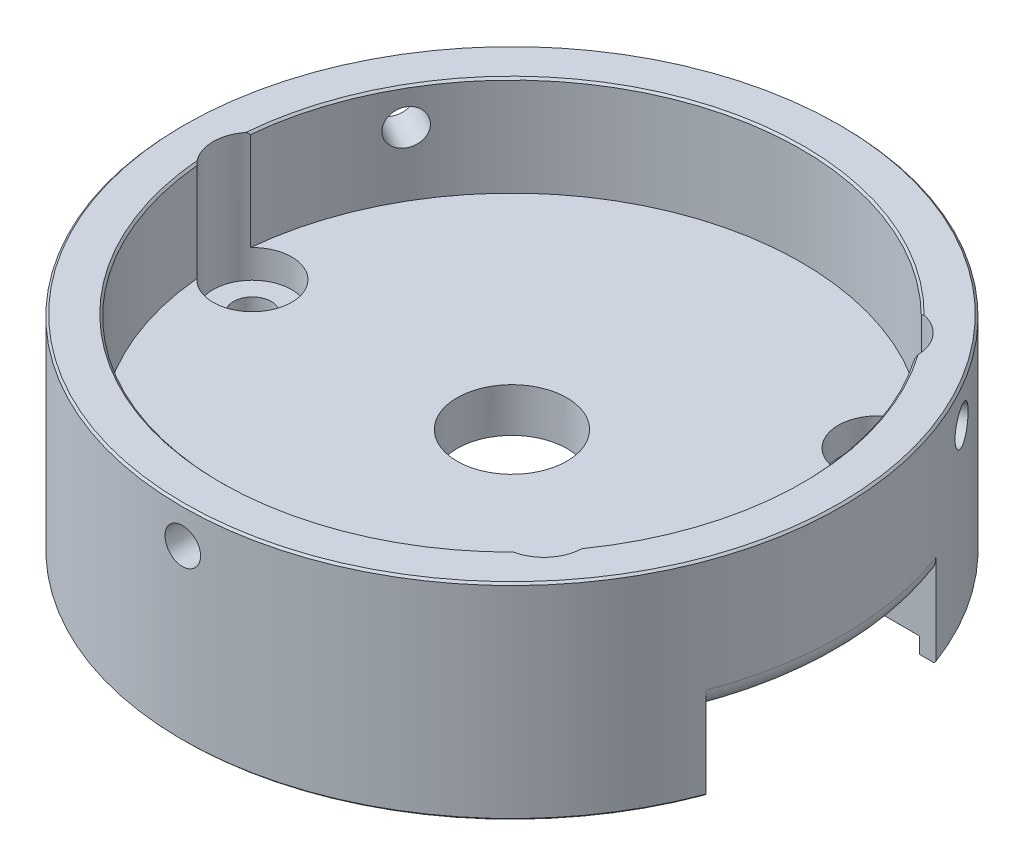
ISO-10303-21;
HEADER;
FILE_DESCRIPTION(('STEP AP214'),'2;1');
FILE_NAME('part.step','',(''),(''),'','','');
FILE_SCHEMA(('AUTOMOTIVE_DESIGN { 1 0 10303 214 1 1 1 1 }'));
ENDSEC;
DATA;
#1=APPLICATION_CONTEXT('core data for automotive mechanical design processes');
#2=APPLICATION_PROTOCOL_DEFINITION('international standard','automotive_design',2000,#1);
#3=PRODUCT_CONTEXT('',#1,'mechanical');
#4=PRODUCT('Part','Part','',(#3));
#5=PRODUCT_RELATED_PRODUCT_CATEGORY('part','',(#4));
#6=PRODUCT_DEFINITION_FORMATION('','',#4);
#7=PRODUCT_DEFINITION_CONTEXT('part definition',#1,'design');
#8=PRODUCT_DEFINITION('design','',#6,#7);
#9=PRODUCT_DEFINITION_SHAPE('','',#8);
#10=(LENGTH_UNIT() NAMED_UNIT(*) SI_UNIT(.MILLI.,.METRE.));
#11=(NAMED_UNIT(*) PLANE_ANGLE_UNIT() SI_UNIT($,.RADIAN.));
#12=(NAMED_UNIT(*) SI_UNIT($,.STERADIAN.) SOLID_ANGLE_UNIT());
#13=UNCERTAINTY_MEASURE_WITH_UNIT(LENGTH_MEASURE(1.E-05),#10,'distance_accuracy_value','');
#14=(GEOMETRIC_REPRESENTATION_CONTEXT(3) GLOBAL_UNCERTAINTY_ASSIGNED_CONTEXT((#13)) GLOBAL_UNIT_ASSIGNED_CONTEXT((#10,
#11,#12)) REPRESENTATION_CONTEXT('',''));
#15=CARTESIAN_POINT('',(0.,0.,0.));
#16=DIRECTION('',(0.,0.,1.));
#17=DIRECTION('',(1.,0.,0.));
#18=AXIS2_PLACEMENT_3D('',#15,#16,#17);
#19=CARTESIAN_POINT('',(0.,0.,0.));
#20=DIRECTION('',(0.,1.,0.));
#21=DIRECTION('',(0.,0.,1.));
#22=AXIS2_PLACEMENT_3D('',#19,#20,#21);
#23=CYLINDRICAL_SURFACE('',#22,3.4925);
#24=CARTESIAN_POINT('',(0.,11.43,0.));
#25=DIRECTION('',(0.,1.,0.));
#26=DIRECTION('',(0.,0.,1.));
#27=AXIS2_PLACEMENT_3D('',#24,#25,#26);
#28=CIRCLE('',#27,3.4925);
#29=CARTESIAN_POINT('',(0.,11.43,3.4925));
#30=VERTEX_POINT('',#29);
#31=EDGE_CURVE('E461',#30,#30,#28,.T.);
#32=ORIENTED_EDGE('',*,*,#31,.T.);
#33=EDGE_LOOP('',(#32));
#34=FACE_BOUND('',#33,.T.);
#35=CARTESIAN_POINT('',(0.,8.636,0.));
#36=DIRECTION('',(0.,-1.,0.));
#37=DIRECTION('',(0.,0.,-1.));
#38=AXIS2_PLACEMENT_3D('',#35,#36,#37);
#39=CIRCLE('',#38,3.4925);
#40=CARTESIAN_POINT('',(0.,8.636,-3.4925));
#41=VERTEX_POINT('',#40);
#42=EDGE_CURVE('E86',#41,#41,#39,.F.);
#43=ORIENTED_EDGE('',*,*,#42,.F.);
#44=EDGE_LOOP('',(#43));
#45=FACE_BOUND('',#44,.T.);
#46=ADVANCED_FACE('F81',(#34,#45),#23,.F.);
#47=CARTESIAN_POINT('',(0.,6.858,0.));
#48=DIRECTION('',(0.,-1.,0.));
#49=DIRECTION('',(0.,0.,-1.));
#50=AXIS2_PLACEMENT_3D('',#47,#48,#49);
#51=CYLINDRICAL_SURFACE('',#50,15.875);
#52=CARTESIAN_POINT('',(0.,5.715,0.));
#53=DIRECTION('',(0.,-1.,0.));
#54=DIRECTION('',(0.,0.,-1.));
#55=AXIS2_PLACEMENT_3D('',#52,#53,#54);
#56=CIRCLE('',#55,15.875);
#57=CARTESIAN_POINT('',(-15.8432007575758,5.715,1.00429814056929));
#58=VERTEX_POINT('',#57);
#59=CARTESIAN_POINT('',(11.4910455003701,5.715,10.9531501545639));
#60=VERTEX_POINT('',#59);
#61=EDGE_CURVE('E105',#58,#60,#56,.F.);
#62=ORIENTED_EDGE('',*,*,#61,.F.);
#63=DIRECTION('',(0.,1.,0.));
#64=VECTOR('',#63,1.);
#65=CARTESIAN_POINT('',(-15.8432007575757,4.815,1.00429814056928));
#66=LINE('',#65,#64);
#67=CARTESIAN_POINT('',(-15.8432007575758,6.858,1.00429814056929));
#68=VERTEX_POINT('',#67);
#69=EDGE_CURVE('E476',#58,#68,#66,.T.);
#70=ORIENTED_EDGE('',*,*,#69,.T.);
#71=CARTESIAN_POINT('',(0.,6.858,0.));
#72=DIRECTION('',(0.,-1.,0.));
#73=DIRECTION('',(0.,0.,-1.));
#74=AXIS2_PLACEMENT_3D('',#71,#72,#73);
#75=CIRCLE('',#74,15.875);
#76=CARTESIAN_POINT('',(11.4910455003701,6.858,10.9531501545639));
#77=VERTEX_POINT('',#76);
#78=EDGE_CURVE('E462',#77,#68,#75,.T.);
#79=ORIENTED_EDGE('',*,*,#78,.F.);
#80=DIRECTION('',(0.,1.,0.));
#81=VECTOR('',#80,1.);
#82=CARTESIAN_POINT('',(11.4910455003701,4.815,10.9531501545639));
#83=LINE('',#82,#81);
#84=EDGE_CURVE('E492',#77,#60,#83,.F.);
#85=ORIENTED_EDGE('',*,*,#84,.T.);
#86=EDGE_LOOP('',(#62,#70,#79,#85));
#87=FACE_BOUND('',#86,.T.);
#88=ADVANCED_FACE('F355',(#87),#51,.F.);
#89=CARTESIAN_POINT('',(0.,5.715,0.));
#90=DIRECTION('',(0.,-1.,0.));
#91=DIRECTION('',(0.,0.,-1.));
#92=AXIS2_PLACEMENT_3D('',#89,#90,#91);
#93=CIRCLE('',#92,15.875);
#94=CARTESIAN_POINT('',(14.0988600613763,5.715,-7.29642172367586));
#95=VERTEX_POINT('',#94);
#96=CARTESIAN_POINT('',(12.7821463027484,5.715,-9.41447613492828));
#97=VERTEX_POINT('',#96);
#98=EDGE_CURVE('E313',#95,#97,#93,.F.);
#99=ORIENTED_EDGE('',*,*,#98,.F.);
#100=DIRECTION('',(0.,-1.,0.));
#101=VECTOR('',#100,1.);
#102=CARTESIAN_POINT('',(14.0988600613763,4.6355,-7.29642172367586));
#103=LINE('',#102,#101);
#104=CARTESIAN_POINT('',(14.0988600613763,6.858,-7.29642172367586));
#105=VERTEX_POINT('',#104);
#106=EDGE_CURVE('E470',#95,#105,#103,.F.);
#107=ORIENTED_EDGE('',*,*,#106,.T.);
#108=CARTESIAN_POINT('',(12.7821463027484,6.858,-9.41447613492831));
#109=VERTEX_POINT('',#108);
#110=EDGE_CURVE('E452',#109,#105,#75,.T.);
#111=ORIENTED_EDGE('',*,*,#110,.F.);
#112=DIRECTION('',(0.,1.,0.));
#113=VECTOR('',#112,1.);
#114=CARTESIAN_POINT('',(12.7821463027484,4.815,-9.41447613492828));
#115=LINE('',#114,#113);
#116=EDGE_CURVE('E654',#109,#97,#115,.F.);
#117=ORIENTED_EDGE('',*,*,#116,.T.);
#118=EDGE_LOOP('',(#99,#107,#111,#117));
#119=FACE_BOUND('',#118,.T.);
#120=ADVANCED_FACE('F361',(#119),#51,.F.);
#121=CARTESIAN_POINT('',(0.,5.715,0.));
#122=DIRECTION('',(0.,-1.,0.));
#123=DIRECTION('',(0.,0.,-1.));
#124=AXIS2_PLACEMENT_3D('',#121,#122,#123);
#125=CIRCLE('',#124,15.875);
#126=CARTESIAN_POINT('',(11.4910455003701,5.715,-10.9531501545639));
#127=VERTEX_POINT('',#126);
#128=CARTESIAN_POINT('',(-15.8432007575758,5.715,-1.00429814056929));
#129=VERTEX_POINT('',#128);
#130=EDGE_CURVE('E306',#127,#129,#125,.F.);
#131=ORIENTED_EDGE('',*,*,#130,.F.);
#132=DIRECTION('',(0.,1.,0.));
#133=VECTOR('',#132,1.);
#134=CARTESIAN_POINT('',(11.4910455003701,4.815,-10.9531501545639));
#135=LINE('',#134,#133);
#136=CARTESIAN_POINT('',(11.4910455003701,6.858,-10.9531501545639));
#137=VERTEX_POINT('',#136);
#138=EDGE_CURVE('E660',#127,#137,#135,.T.);
#139=ORIENTED_EDGE('',*,*,#138,.T.);
#140=CARTESIAN_POINT('',(-15.8432007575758,6.858,-1.00429814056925));
#141=VERTEX_POINT('',#140);
#142=EDGE_CURVE('E463',#141,#137,#75,.T.);
#143=ORIENTED_EDGE('',*,*,#142,.F.);
#144=DIRECTION('',(0.,1.,0.));
#145=VECTOR('',#144,1.);
#146=CARTESIAN_POINT('',(-15.8432007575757,4.815,-1.00429814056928));
#147=LINE('',#146,#145);
#148=EDGE_CURVE('E478',#141,#129,#147,.F.);
#149=ORIENTED_EDGE('',*,*,#148,.T.);
#150=EDGE_LOOP('',(#131,#139,#143,#149));
#151=FACE_BOUND('',#150,.T.);
#152=ADVANCED_FACE('F685',(#151),#51,.F.);
#153=CARTESIAN_POINT('',(0.,5.715,0.));
#154=DIRECTION('',(0.,-1.,0.));
#155=DIRECTION('',(0.,0.,-1.));
#156=AXIS2_PLACEMENT_3D('',#153,#154,#155);
#157=CIRCLE('',#156,15.875);
#158=CARTESIAN_POINT('',(12.7821463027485,5.715,9.41447613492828));
#159=VERTEX_POINT('',#158);
#160=CARTESIAN_POINT('',(14.0988600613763,5.715,7.29642172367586));
#161=VERTEX_POINT('',#160);
#162=EDGE_CURVE('E295',#159,#161,#157,.F.);
#163=ORIENTED_EDGE('',*,*,#162,.F.);
#164=DIRECTION('',(0.,1.,0.));
#165=VECTOR('',#164,1.);
#166=CARTESIAN_POINT('',(12.7821463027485,4.815,9.41447613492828));
#167=LINE('',#166,#165);
#168=CARTESIAN_POINT('',(12.7821463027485,6.858,9.41447613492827));
#169=VERTEX_POINT('',#168);
#170=EDGE_CURVE('E490',#159,#169,#167,.T.);
#171=ORIENTED_EDGE('',*,*,#170,.T.);
#172=CARTESIAN_POINT('',(14.0988600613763,6.858,7.29642172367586));
#173=VERTEX_POINT('',#172);
#174=EDGE_CURVE('E458',#173,#169,#75,.T.);
#175=ORIENTED_EDGE('',*,*,#174,.F.);
#176=DIRECTION('',(0.,-1.,0.));
#177=VECTOR('',#176,1.);
#178=CARTESIAN_POINT('',(14.0988600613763,4.6355,7.29642172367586));
#179=LINE('',#178,#177);
#180=EDGE_CURVE('E473',#173,#161,#179,.T.);
#181=ORIENTED_EDGE('',*,*,#180,.T.);
#182=EDGE_LOOP('',(#163,#171,#175,#181));
#183=FACE_BOUND('',#182,.T.);
#184=ADVANCED_FACE('F364',(#183),#51,.F.);
#185=CARTESIAN_POINT('',(14.396746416,9.271,0.));
#186=DIRECTION('',(0.,-1.,0.));
#187=DIRECTION('',(0.,0.,-1.));
#188=AXIS2_PLACEMENT_3D('',#185,#186,#187);
#189=CYLINDRICAL_SURFACE('',#188,7.3025);
#190=CARTESIAN_POINT('',(14.396746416,8.636,0.));
#191=DIRECTION('',(0.,-1.,0.));
#192=DIRECTION('',(0.,0.,-1.));
#193=AXIS2_PLACEMENT_3D('',#190,#191,#192);
#194=CIRCLE('',#193,7.3025);
#195=CARTESIAN_POINT('',(9.88364637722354,8.636,-5.74094367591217));
#196=VERTEX_POINT('',#195);
#197=CARTESIAN_POINT('',(9.88364637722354,8.636,5.74094367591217));
#198=VERTEX_POINT('',#197);
#199=EDGE_CURVE('E288',#196,#198,#194,.F.);
#200=ORIENTED_EDGE('',*,*,#199,.F.);
#201=DIRECTION('',(0.,-1.,0.));
#202=VECTOR('',#201,1.);
#203=CARTESIAN_POINT('',(9.88364637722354,7.747,-5.74094367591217));
#204=LINE('',#203,#202);
#205=CARTESIAN_POINT('',(9.88364637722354,6.858,-5.74094367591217));
#206=VERTEX_POINT('',#205);
#207=EDGE_CURVE('E278',#196,#206,#204,.T.);
#208=ORIENTED_EDGE('',*,*,#207,.T.);
#209=CARTESIAN_POINT('',(14.396746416,6.858,0.));
#210=DIRECTION('',(0.,-1.,0.));
#211=DIRECTION('',(0.,0.,-1.));
#212=AXIS2_PLACEMENT_3D('',#209,#210,#211);
#213=CIRCLE('',#212,7.3025);
#214=EDGE_CURVE('E454',#206,#105,#213,.T.);
#215=ORIENTED_EDGE('',*,*,#214,.T.);
#216=ORIENTED_EDGE('',*,*,#106,.F.);
#217=CARTESIAN_POINT('',(14.396746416,5.715,0.));
#218=DIRECTION('',(0.,-1.,0.));
#219=DIRECTION('',(0.,0.,-1.));
#220=AXIS2_PLACEMENT_3D('',#217,#218,#219);
#221=CIRCLE('',#220,7.3025);
#222=CARTESIAN_POINT('',(14.396746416,5.715,-7.3025));
#223=VERTEX_POINT('',#222);
#224=EDGE_CURVE('E307',#223,#95,#221,.F.);
#225=ORIENTED_EDGE('',*,*,#224,.F.);
#226=DIRECTION('',(0.,-1.,0.));
#227=VECTOR('',#226,1.);
#228=CARTESIAN_POINT('',(14.396746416,9.271,-7.3025));
#229=LINE('',#228,#227);
#230=CARTESIAN_POINT('',(14.396746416,9.271,-7.3025));
#231=VERTEX_POINT('',#230);
#232=EDGE_CURVE('E601',#231,#223,#229,.T.);
#233=ORIENTED_EDGE('',*,*,#232,.F.);
#234=CARTESIAN_POINT('',(14.396746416,9.271,0.));
#235=DIRECTION('',(0.,-1.,0.));
#236=DIRECTION('',(0.,0.,-1.));
#237=AXIS2_PLACEMENT_3D('',#234,#235,#236);
#238=CIRCLE('',#237,7.3025);
#239=CARTESIAN_POINT('',(14.396746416,9.271,7.3025));
#240=VERTEX_POINT('',#239);
#241=EDGE_CURVE('E629',#240,#231,#238,.T.);
#242=ORIENTED_EDGE('',*,*,#241,.F.);
#243=DIRECTION('',(0.,-1.,0.));
#244=VECTOR('',#243,1.);
#245=CARTESIAN_POINT('',(14.396746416,9.271,7.3025));
#246=LINE('',#245,#244);
#247=CARTESIAN_POINT('',(14.396746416,5.715,7.3025));
#248=VERTEX_POINT('',#247);
#249=EDGE_CURVE('E626',#240,#248,#246,.T.);
#250=ORIENTED_EDGE('',*,*,#249,.T.);
#251=EDGE_CURVE('E304',#161,#248,#221,.F.);
#252=ORIENTED_EDGE('',*,*,#251,.F.);
#253=ORIENTED_EDGE('',*,*,#180,.F.);
#254=CARTESIAN_POINT('',(9.88364637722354,6.858,5.74094367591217));
#255=VERTEX_POINT('',#254);
#256=EDGE_CURVE('E450',#173,#255,#213,.T.);
#257=ORIENTED_EDGE('',*,*,#256,.T.);
#258=DIRECTION('',(0.,-1.,0.));
#259=VECTOR('',#258,1.);
#260=CARTESIAN_POINT('',(9.88364637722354,7.747,5.74094367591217));
#261=LINE('',#260,#259);
#262=EDGE_CURVE('E97',#255,#198,#261,.F.);
#263=ORIENTED_EDGE('',*,*,#262,.T.);
#264=EDGE_LOOP('',(#200,#208,#215,#216,#225,#233,#242,#250,#252,#253,#257,#263));
#265=FACE_BOUND('',#264,.T.);
#266=ADVANCED_FACE('F290',(#265),#189,.F.);
#267=CARTESIAN_POINT('',(-16.5,11.43,0.));
#268=DIRECTION('',(0.,1.,0.));
#269=DIRECTION('',(0.,0.,1.));
#270=AXIS2_PLACEMENT_3D('',#267,#268,#269);
#271=CYLINDRICAL_SURFACE('',#270,1.2);
#272=CARTESIAN_POINT('',(-16.5,9.63,0.));
#273=DIRECTION('',(0.,1.,0.));
#274=DIRECTION('',(0.,0.,1.));
#275=AXIS2_PLACEMENT_3D('',#272,#273,#274);
#276=CIRCLE('',#275,1.2);
#277=CARTESIAN_POINT('',(-16.5,9.63,1.2));
#278=VERTEX_POINT('',#277);
#279=EDGE_CURVE('E666',#278,#278,#276,.T.);
#280=ORIENTED_EDGE('',*,*,#279,.T.);
#281=EDGE_LOOP('',(#280));
#282=FACE_BOUND('',#281,.T.);
#283=CARTESIAN_POINT('',(-16.5,5.715,0.));
#284=DIRECTION('',(0.,-1.,0.));
#285=DIRECTION('',(0.,0.,-1.));
#286=AXIS2_PLACEMENT_3D('',#283,#284,#285);
#287=CIRCLE('',#286,1.2);
#288=EDGE_CURVE('E302',#129,#58,#287,.F.);
#289=ORIENTED_EDGE('',*,*,#288,.F.);
#290=ORIENTED_EDGE('',*,*,#148,.F.);
#291=CARTESIAN_POINT('',(-16.5,6.858,0.));
#292=DIRECTION('',(0.,-1.,0.));
#293=DIRECTION('',(0.,0.,-1.));
#294=AXIS2_PLACEMENT_3D('',#291,#292,#293);
#295=CIRCLE('',#294,1.2);
#296=EDGE_CURVE('E678',#141,#68,#295,.T.);
#297=ORIENTED_EDGE('',*,*,#296,.T.);
#298=ORIENTED_EDGE('',*,*,#69,.F.);
#299=EDGE_LOOP('',(#289,#290,#297,#298));
#300=FACE_BOUND('',#299,.T.);
#301=ADVANCED_FACE('F684',(#282,#300),#271,.F.);
#302=CARTESIAN_POINT('',(12.6397333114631,11.43,-10.6059955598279));
#303=DIRECTION('',(0.,1.,0.));
#304=DIRECTION('',(0.,0.,1.));
#305=AXIS2_PLACEMENT_3D('',#302,#303,#304);
#306=CYLINDRICAL_SURFACE('',#305,1.2);
#307=CARTESIAN_POINT('',(12.6397333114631,9.63,-10.6059955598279));
#308=DIRECTION('',(0.,1.,0.));
#309=DIRECTION('',(0.,0.,1.));
#310=AXIS2_PLACEMENT_3D('',#307,#308,#309);
#311=CIRCLE('',#310,1.2);
#312=CARTESIAN_POINT('',(12.6397333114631,9.63,-9.40599555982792));
#313=VERTEX_POINT('',#312);
#314=EDGE_CURVE('E669',#313,#313,#311,.T.);
#315=ORIENTED_EDGE('',*,*,#314,.T.);
#316=EDGE_LOOP('',(#315));
#317=FACE_BOUND('',#316,.T.);
#318=CARTESIAN_POINT('',(12.6397333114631,5.715,-10.6059955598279));
#319=DIRECTION('',(0.,-1.,0.));
#320=DIRECTION('',(0.,0.,-1.));
#321=AXIS2_PLACEMENT_3D('',#318,#319,#320);
#322=CIRCLE('',#321,1.2);
#323=EDGE_CURVE('E309',#97,#127,#322,.F.);
#324=ORIENTED_EDGE('',*,*,#323,.F.);
#325=ORIENTED_EDGE('',*,*,#116,.F.);
#326=CARTESIAN_POINT('',(12.6397333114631,6.858,-10.6059955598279));
#327=DIRECTION('',(0.,-1.,0.));
#328=DIRECTION('',(0.,0.,-1.));
#329=AXIS2_PLACEMENT_3D('',#326,#327,#328);
#330=CIRCLE('',#329,1.2);
#331=EDGE_CURVE('E484',#109,#137,#330,.T.);
#332=ORIENTED_EDGE('',*,*,#331,.T.);
#333=ORIENTED_EDGE('',*,*,#138,.F.);
#334=EDGE_LOOP('',(#324,#325,#332,#333));
#335=FACE_BOUND('',#334,.T.);
#336=ADVANCED_FACE('F659',(#317,#335),#306,.F.);
#337=CARTESIAN_POINT('',(12.6397333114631,11.43,10.6059955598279));
#338=DIRECTION('',(0.,1.,0.));
#339=DIRECTION('',(0.,0.,1.));
#340=AXIS2_PLACEMENT_3D('',#337,#338,#339);
#341=CYLINDRICAL_SURFACE('',#340,1.2);
#342=CARTESIAN_POINT('',(12.6397333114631,9.63,10.6059955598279));
#343=DIRECTION('',(0.,1.,0.));
#344=DIRECTION('',(0.,0.,1.));
#345=AXIS2_PLACEMENT_3D('',#342,#343,#344);
#346=CIRCLE('',#345,1.2);
#347=CARTESIAN_POINT('',(12.6397333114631,9.63,11.8059955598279));
#348=VERTEX_POINT('',#347);
#349=EDGE_CURVE('E692',#348,#348,#346,.T.);
#350=ORIENTED_EDGE('',*,*,#349,.T.);
#351=EDGE_LOOP('',(#350));
#352=FACE_BOUND('',#351,.T.);
#353=CARTESIAN_POINT('',(12.6397333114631,5.715,10.6059955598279));
#354=DIRECTION('',(0.,-1.,0.));
#355=DIRECTION('',(0.,0.,-1.));
#356=AXIS2_PLACEMENT_3D('',#353,#354,#355);
#357=CIRCLE('',#356,1.2);
#358=EDGE_CURVE('E431',#60,#159,#357,.F.);
#359=ORIENTED_EDGE('',*,*,#358,.F.);
#360=ORIENTED_EDGE('',*,*,#84,.F.);
#361=CARTESIAN_POINT('',(12.6397333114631,6.858,10.6059955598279));
#362=DIRECTION('',(0.,-1.,0.));
#363=DIRECTION('',(0.,0.,-1.));
#364=AXIS2_PLACEMENT_3D('',#361,#362,#363);
#365=CIRCLE('',#364,1.2);
#366=EDGE_CURVE('E645',#77,#169,#365,.T.);
#367=ORIENTED_EDGE('',*,*,#366,.T.);
#368=ORIENTED_EDGE('',*,*,#170,.F.);
#369=EDGE_LOOP('',(#359,#360,#367,#368));
#370=FACE_BOUND('',#369,.T.);
#371=ADVANCED_FACE('F687',(#352,#370),#341,.F.);
#372=CARTESIAN_POINT('',(0.,11.43,0.));
#373=DIRECTION('',(0.,1.,0.));
#374=DIRECTION('',(0.,0.,1.));
#375=AXIS2_PLACEMENT_3D('',#372,#373,#374);
#376=CYLINDRICAL_SURFACE('',#375,18.4023);
#377=CARTESIAN_POINT('',(0.,14.3637,18.4023));
#378=CARTESIAN_POINT('',(0.0634252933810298,14.3637027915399,18.4022995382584));
#379=CARTESIAN_POINT('',(0.126895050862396,14.3690564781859,18.4019685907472));
#380=CARTESIAN_POINT('',(0.252082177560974,14.3903366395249,18.4006801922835));
#381=CARTESIAN_POINT('',(0.313797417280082,14.4062754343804,18.3997220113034));
#382=CARTESIAN_POINT('',(0.433644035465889,14.4482664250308,18.3972875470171));
#383=CARTESIAN_POINT('',(0.491777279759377,14.4743133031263,18.3958115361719));
#384=CARTESIAN_POINT('',(0.602831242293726,14.5357725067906,18.3925074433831));
#385=CARTESIAN_POINT('',(0.655753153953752,14.5711826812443,18.3906794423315));
#386=CARTESIAN_POINT('',(0.754974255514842,14.6504197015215,18.3868738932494));
#387=CARTESIAN_POINT('',(0.801264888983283,14.6942572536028,18.3848961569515));
#388=CARTESIAN_POINT('',(0.885836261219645,14.7890826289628,18.3810156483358));
#389=CARTESIAN_POINT('',(0.92411666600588,14.8400707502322,18.3791128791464));
#390=CARTESIAN_POINT('',(0.991607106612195,14.9477980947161,18.3755954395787));
#391=CARTESIAN_POINT('',(1.02081006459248,15.0045417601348,18.3739809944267));
#392=CARTESIAN_POINT('',(1.06927134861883,15.1221382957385,18.3712246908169));
#393=CARTESIAN_POINT('',(1.08852977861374,15.1829911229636,18.3700828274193));
#394=CARTESIAN_POINT('',(1.11653166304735,15.3069964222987,18.3684022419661));
#395=CARTESIAN_POINT('',(1.12528847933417,15.3701458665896,18.3678627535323));
#396=CARTESIAN_POINT('',(1.13207980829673,15.4970204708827,18.3674454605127));
#397=CARTESIAN_POINT('',(1.13011443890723,15.560745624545,18.3675676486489));
#398=CARTESIAN_POINT('',(1.1155282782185,15.6868716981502,18.3684592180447));
#399=CARTESIAN_POINT('',(1.10292194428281,15.7492742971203,18.3692277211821));
#400=CARTESIAN_POINT('',(1.06743412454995,15.8710759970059,18.3713239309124));
#401=CARTESIAN_POINT('',(1.04455257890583,15.9304750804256,18.3726516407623));
#402=CARTESIAN_POINT('',(0.989147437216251,16.0446300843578,18.3757176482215));
#403=CARTESIAN_POINT('',(0.956617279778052,16.0993828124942,18.3774562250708));
#404=CARTESIAN_POINT('',(0.882843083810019,16.2026559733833,18.3811477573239));
#405=CARTESIAN_POINT('',(0.841598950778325,16.2511763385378,18.3831007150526));
#406=CARTESIAN_POINT('',(0.751486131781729,16.3406915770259,18.3870048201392));
#407=CARTESIAN_POINT('',(0.702604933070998,16.3816738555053,18.3889559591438));
#408=CARTESIAN_POINT('',(0.598649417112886,16.4548524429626,18.3926334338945));
#409=CARTESIAN_POINT('',(0.543575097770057,16.4870487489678,18.3943597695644));
#410=CARTESIAN_POINT('',(0.428789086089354,16.5417403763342,18.397393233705));
#411=CARTESIAN_POINT('',(0.369077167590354,16.5642352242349,18.3987003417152));
#412=CARTESIAN_POINT('',(0.246714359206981,16.5988769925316,18.4007477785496));
#413=CARTESIAN_POINT('',(0.184063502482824,16.6110240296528,18.4014881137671));
#414=CARTESIAN_POINT('',(0.0577105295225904,16.6246097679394,18.4023177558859));
#415=CARTESIAN_POINT('',(-0.00598970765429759,16.6260658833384,18.4024081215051));
#416=CARTESIAN_POINT('',(-0.132729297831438,16.6182739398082,18.4019304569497));
#417=CARTESIAN_POINT('',(-0.195768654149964,16.6090259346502,18.4013624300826));
#418=CARTESIAN_POINT('',(-0.319347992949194,16.580102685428,18.3996326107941));
#419=CARTESIAN_POINT('',(-0.379889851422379,16.5604354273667,18.3984712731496));
#420=CARTESIAN_POINT('',(-0.496813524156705,16.5112400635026,18.3956854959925));
#421=CARTESIAN_POINT('',(-0.553195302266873,16.4817118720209,18.3940610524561));
#422=CARTESIAN_POINT('',(-0.660278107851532,16.4135884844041,18.3905289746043));
#423=CARTESIAN_POINT('',(-0.710971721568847,16.3749816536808,18.3886209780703));
#424=CARTESIAN_POINT('',(-0.805164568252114,16.2898138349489,18.3847377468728));
#425=CARTESIAN_POINT('',(-0.8486637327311,16.2432527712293,18.3827625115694));
#426=CARTESIAN_POINT('',(-0.927291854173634,16.1434230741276,18.3789643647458));
#427=CARTESIAN_POINT('',(-0.962409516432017,16.090145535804,18.3771416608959));
#428=CARTESIAN_POINT('',(-1.02320051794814,15.9784400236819,18.3738574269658));
#429=CARTESIAN_POINT('',(-1.04887391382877,15.9200120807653,18.3723958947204));
#430=CARTESIAN_POINT('',(-1.090028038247,15.7997056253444,18.3700003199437));
#431=CARTESIAN_POINT('',(-1.10551588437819,15.7378295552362,18.3690659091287));
#432=CARTESIAN_POINT('',(-1.12588251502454,15.6123493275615,18.3678289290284));
#433=CARTESIAN_POINT('',(-1.13076140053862,15.5487451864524,18.3675263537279));
#434=CARTESIAN_POINT('',(-1.12977064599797,15.4217266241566,18.3675873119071));
#435=CARTESIAN_POINT('',(-1.12391876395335,15.3583120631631,18.3679497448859));
#436=CARTESIAN_POINT('',(-1.10166939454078,15.2333677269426,18.3692975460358));
#437=CARTESIAN_POINT('',(-1.08527188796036,15.1718379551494,18.3702829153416));
#438=CARTESIAN_POINT('',(-1.04240069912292,15.0524070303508,18.3727652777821));
#439=CARTESIAN_POINT('',(-1.01592707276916,14.9945058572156,18.3742622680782));
#440=CARTESIAN_POINT('',(-0.95365762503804,14.883967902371,18.377599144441));
#441=CARTESIAN_POINT('',(-0.917862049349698,14.8313309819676,18.3794390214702));
#442=CARTESIAN_POINT('',(-0.837899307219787,14.7327257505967,18.3832578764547));
#443=CARTESIAN_POINT('',(-0.793719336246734,14.6867678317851,18.3852370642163));
#444=CARTESIAN_POINT('',(-0.698258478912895,14.6029051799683,18.3891097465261));
#445=CARTESIAN_POINT('',(-0.646975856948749,14.5650024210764,18.3910032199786));
#446=CARTESIAN_POINT('',(-0.538708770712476,14.4982990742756,18.394493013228));
#447=CARTESIAN_POINT('',(-0.481717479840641,14.4695095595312,18.396088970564));
#448=CARTESIAN_POINT('',(-0.363741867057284,14.4219430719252,18.3987989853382));
#449=CARTESIAN_POINT('',(-0.302762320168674,14.4031543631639,18.39991360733));
#450=CARTESIAN_POINT('',(-0.201174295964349,14.381010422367,18.4012430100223));
#451=CARTESIAN_POINT('',(-0.161222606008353,14.3745273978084,18.4016376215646));
#452=CARTESIAN_POINT('',(-0.0808533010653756,14.3658712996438,18.4021662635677));
#453=CARTESIAN_POINT('',(-0.0404356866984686,14.3636982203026,18.4023002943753));
#454=CARTESIAN_POINT('',(0.,14.3637,18.4023));
#455=B_SPLINE_CURVE_WITH_KNOTS('',3,(#377,#378,#379,#380,#381,#382,#383,#384,#385,#386,#387,
#388,#389,#390,#391,#392,#393,#394,#395,#396,#397,#398,#399,#400,#401,#402,#403,#404,#405,#406,
#407,#408,#409,#410,#411,#412,#413,#414,#415,#416,#417,#418,#419,#420,#421,#422,#423,#424,#425,
#426,#427,#428,#429,#430,#431,#432,#433,#434,#435,#436,#437,#438,#439,#440,#441,#442,#443,#444,
#445,#446,#447,#448,#449,#450,#451,#452,#453,#454),.UNSPECIFIED.,.T.,.F.,(4,2,2,2,2,2,2,2,2,2,2,
2,2,2,2,2,2,2,2,2,2,2,2,2,2,2,2,2,2,2,2,2,2,2,2,2,2,2,4),(0.,0.19012826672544,0.380478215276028,
0.570728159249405,0.760934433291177,0.9513839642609,1.14184143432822,1.33244703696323,
1.52305064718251,1.71341148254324,1.90377022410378,2.09387074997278,2.28397238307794,
2.47420358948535,2.66443685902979,2.8549851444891,3.04553349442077,3.236091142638,
3.42664664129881,3.61689167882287,3.8071357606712,3.9972342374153,4.18733436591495,
4.37767945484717,4.56802635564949,4.75862833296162,4.94922916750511,5.13969666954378,
5.33016235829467,5.52031313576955,5.71046425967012,5.90061432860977,6.09075938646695,
6.28119720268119,6.471681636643,6.66239664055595,6.85288734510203,6.97410045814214,
7.09531340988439),.UNSPECIFIED.);
#456=CARTESIAN_POINT('',(0.,14.3637,18.4023));
#457=VERTEX_POINT('',#456);
#458=EDGE_CURVE('E385',#457,#457,#455,.T.);
#459=ORIENTED_EDGE('',*,*,#458,.T.);
#460=EDGE_LOOP('',(#459));
#461=FACE_BOUND('',#460,.T.);
#462=CARTESIAN_POINT('',(0.,11.43,0.));
#463=DIRECTION('',(0.,1.,0.));
#464=DIRECTION('',(0.,0.,1.));
#465=AXIS2_PLACEMENT_3D('',#462,#463,#464);
#466=CIRCLE('',#465,18.4023);
#467=CARTESIAN_POINT('',(-18.3225650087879,11.43,1.71121500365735));
#468=VERTEX_POINT('',#467);
#469=CARTESIAN_POINT('',(12.9359513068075,11.43,13.0883845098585));
#470=VERTEX_POINT('',#469);
#471=EDGE_CURVE('E469',#468,#470,#466,.T.);
#472=ORIENTED_EDGE('',*,*,#471,.F.);
#473=DIRECTION('',(0.,1.,0.));
#474=VECTOR('',#473,1.);
#475=CARTESIAN_POINT('',(-18.3225650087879,14.5415,1.71121500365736));
#476=LINE('',#475,#474);
#477=CARTESIAN_POINT('',(-18.3225650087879,17.653,1.71121500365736));
#478=VERTEX_POINT('',#477);
#479=EDGE_CURVE('E960',#478,#468,#476,.F.);
#480=ORIENTED_EDGE('',*,*,#479,.F.);
#481=CARTESIAN_POINT('',(0.,17.653,0.));
#482=DIRECTION('',(0.,1.,0.));
#483=DIRECTION('',(0.,0.,1.));
#484=AXIS2_PLACEMENT_3D('',#481,#482,#483);
#485=CIRCLE('',#484,18.4023);
#486=CARTESIAN_POINT('',(12.9359513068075,17.653,13.0883845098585));
#487=VERTEX_POINT('',#486);
#488=EDGE_CURVE('E613',#478,#487,#485,.T.);
#489=ORIENTED_EDGE('',*,*,#488,.T.);
#490=DIRECTION('',(0.,1.,0.));
#491=VECTOR('',#490,1.);
#492=CARTESIAN_POINT('',(12.9359513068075,14.5415,13.0883845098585));
#493=LINE('',#492,#491);
#494=EDGE_CURVE('E970',#470,#487,#493,.T.);
#495=ORIENTED_EDGE('',*,*,#494,.F.);
#496=EDGE_LOOP('',(#472,#480,#489,#495));
#497=FACE_BOUND('',#496,.T.);
#498=ADVANCED_FACE('F380',(#461,#497),#376,.F.);
#499=CARTESIAN_POINT('',(0.,17.653,0.));
#500=DIRECTION('',(0.,1.,0.));
#501=DIRECTION('',(0.,0.,1.));
#502=AXIS2_PLACEMENT_3D('',#499,#500,#501);
#503=CONICAL_SURFACE('',#502,18.4023,0.785398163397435);
#504=CARTESIAN_POINT('',(-18.4649203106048,17.7801999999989,-1.54566754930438));
#505=CARTESIAN_POINT('',(-18.4420389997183,17.7598277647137,-1.57471843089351));
#506=CARTESIAN_POINT('',(-18.4187168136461,17.73902497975,-1.60305928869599));
#507=CARTESIAN_POINT('',(-18.3711906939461,17.6965583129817,-1.65832095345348));
#508=CARTESIAN_POINT('',(-18.3469867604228,17.6748944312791,-1.68524176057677));
#509=CARTESIAN_POINT('',(-18.3223419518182,17.6528,-1.71145254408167));
#510=B_SPLINE_CURVE_WITH_KNOTS('',3,(#504,#505,#506,#507,#508,#509),.UNSPECIFIED.,.F.,.F.,(4,2,
4),(0.,0.126566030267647,0.253132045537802),.UNSPECIFIED.);
#511=CARTESIAN_POINT('',(-18.4646957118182,17.78,-1.5459530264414));
#512=VERTEX_POINT('',#511);
#513=CARTESIAN_POINT('',(-18.3225650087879,17.653,-1.71121500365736));
#514=VERTEX_POINT('',#513);
#515=EDGE_CURVE('E330',#512,#514,#510,.T.);
#516=ORIENTED_EDGE('',*,*,#515,.T.);
#517=CARTESIAN_POINT('',(12.9359513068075,17.653,-13.0883845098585));
#518=VERTEX_POINT('',#517);
#519=EDGE_CURVE('E610',#518,#514,#485,.T.);
#520=ORIENTED_EDGE('',*,*,#519,.F.);
#521=CARTESIAN_POINT('',(12.3338773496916,17.2340183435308,-13.0872154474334));
#522=CARTESIAN_POINT('',(12.4657803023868,17.3363623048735,-13.1034940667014));
#523=CARTESIAN_POINT('',(12.6026000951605,17.4352413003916,-13.1096366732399));
#524=CARTESIAN_POINT('',(12.8837131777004,17.6229127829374,-13.0980742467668));
#525=CARTESIAN_POINT('',(13.0280630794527,17.711605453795,-13.0801520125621));
#526=CARTESIAN_POINT('',(13.2860154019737,17.8551873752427,-13.0237460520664));
#527=CARTESIAN_POINT('',(13.3990941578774,17.9131674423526,-12.990906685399));
#528=CARTESIAN_POINT('',(13.6236494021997,18.0174700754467,-12.9073394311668));
#529=CARTESIAN_POINT('',(13.735130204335,18.0638340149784,-12.8566766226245));
#530=CARTESIAN_POINT('',(13.9391428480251,18.1375208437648,-12.7445232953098));
#531=CARTESIAN_POINT('',(14.0322766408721,18.1665191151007,-12.6852413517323));
#532=CARTESIAN_POINT('',(14.2117626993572,18.2122944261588,-12.5530767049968));
#533=CARTESIAN_POINT('',(14.2981146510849,18.2290709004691,-12.4801933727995));
#534=CARTESIAN_POINT('',(14.4591321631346,18.2490993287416,-12.3241578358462));
#535=CARTESIAN_POINT('',(14.5340104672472,18.2526365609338,-12.2412624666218));
#536=CARTESIAN_POINT('',(14.6718024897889,18.2467483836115,-12.0665006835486));
#537=CARTESIAN_POINT('',(14.7347176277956,18.2373245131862,-11.9746353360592));
#538=CARTESIAN_POINT('',(14.8468694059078,18.2061681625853,-11.7852490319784));
#539=CARTESIAN_POINT('',(14.8961430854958,18.1844695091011,-11.6877442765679));
#540=CARTESIAN_POINT('',(14.9807655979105,18.1300199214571,-11.4898323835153));
#541=CARTESIAN_POINT('',(15.0161066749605,18.0972628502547,-11.3894236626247));
#542=CARTESIAN_POINT('',(15.0735597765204,18.0217919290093,-11.1871111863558));
#543=CARTESIAN_POINT('',(15.095500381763,17.9789583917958,-11.0852044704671));
#544=CARTESIAN_POINT('',(15.12640438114,17.8852373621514,-10.8832952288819));
#545=CARTESIAN_POINT('',(15.1353768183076,17.8343555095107,-10.7832914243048));
#546=CARTESIAN_POINT('',(15.1408220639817,17.7394967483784,-10.6110750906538));
#547=CARTESIAN_POINT('',(15.1398461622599,17.6969442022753,-10.5381297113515));
#548=CARTESIAN_POINT('',(15.1294130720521,17.5823037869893,-10.3516580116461));
#549=CARTESIAN_POINT('',(15.1152407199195,17.5077484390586,-10.2399010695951));
#550=CARTESIAN_POINT('',(15.0733364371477,17.3521209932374,-10.0230727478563));
#551=CARTESIAN_POINT('',(15.0455591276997,17.2710278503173,-9.91802508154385));
#552=CARTESIAN_POINT('',(15.0120140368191,17.1877263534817,-9.81714566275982));
#553=B_SPLINE_CURVE_WITH_KNOTS('',3,(#521,#522,#523,#524,#525,#526,#527,#528,#529,#530,#531,
#532,#533,#534,#535,#536,#537,#538,#539,#540,#541,#542,#543,#544,#545,#546,#547,#548,#549,#550,
#551,#552),.UNSPECIFIED.,.F.,.F.,(4,2,2,2,2,2,2,2,2,2,2,2,2,2,2,4),(0.,0.504060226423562,
1.01270064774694,1.40493458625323,1.79575096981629,2.13666497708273,2.47759475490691,
2.81113445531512,3.14463455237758,3.47722004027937,3.80999040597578,4.146932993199,
4.48364050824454,4.73670969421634,5.14084927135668,5.54634611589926),.UNSPECIFIED.);
#554=CARTESIAN_POINT('',(13.1510580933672,17.78,-13.0531463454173));
#555=VERTEX_POINT('',#554);
#556=EDGE_CURVE('E981',#518,#555,#553,.T.);
#557=ORIENTED_EDGE('',*,*,#556,.T.);
#558=CARTESIAN_POINT('',(0.,17.78,0.));
#559=DIRECTION('',(0.,1.,0.));
#560=DIRECTION('',(0.,0.,1.));
#561=AXIS2_PLACEMENT_3D('',#558,#559,#560);
#562=CIRCLE('',#561,18.5293);
#563=EDGE_CURVE('E587',#512,#555,#562,.F.);
#564=ORIENTED_EDGE('',*,*,#563,.F.);
#565=EDGE_LOOP('',(#516,#520,#557,#564));
#566=FACE_BOUND('',#565,.T.);
#567=ADVANCED_FACE('F545',(#566),#503,.F.);
#568=CARTESIAN_POINT('',(15.3416190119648,15.494,-10.1626458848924));
#569=CARTESIAN_POINT('',(15.3416208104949,15.5574251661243,-10.1626436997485));
#570=CARTESIAN_POINT('',(15.3445848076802,15.620894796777,-10.1581730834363));
#571=CARTESIAN_POINT('',(15.3563426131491,15.7460816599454,-10.1403893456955));
#572=CARTESIAN_POINT('',(15.3651432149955,15.8077967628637,-10.1270659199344));
#573=CARTESIAN_POINT('',(15.3882500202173,15.9276430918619,-10.0919198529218));
#574=CARTESIAN_POINT('',(15.4025533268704,15.9857761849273,-10.0701016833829));
#575=CARTESIAN_POINT('',(15.4361470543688,16.0968298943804,-10.0185304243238));
#576=CARTESIAN_POINT('',(15.4554363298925,16.149751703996,-9.98877915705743));
#577=CARTESIAN_POINT('',(15.4983518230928,16.2489729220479,-9.92206161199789));
#578=CARTESIAN_POINT('',(15.5219835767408,16.2952637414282,-9.88508612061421));
#579=CARTESIAN_POINT('',(15.5727562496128,16.3798354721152,-9.80490464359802));
#580=CARTESIAN_POINT('',(15.5998973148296,16.4181160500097,-9.76169839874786));
#581=CARTESIAN_POINT('',(15.6568047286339,16.4856066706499,-9.67016096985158));
#582=CARTESIAN_POINT('',(15.6865730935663,16.5148096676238,-9.6218258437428));
#583=CARTESIAN_POINT('',(15.7477551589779,16.5632710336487,-9.52136063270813));
#584=CARTESIAN_POINT('',(15.7791688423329,16.5825295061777,-9.46923058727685));
#585=CARTESIAN_POINT('',(15.8426243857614,16.6105314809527,-9.36267781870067));
#586=CARTESIAN_POINT('',(15.8746653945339,16.6192883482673,-9.3082581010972));
#587=CARTESIAN_POINT('',(15.9384633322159,16.6260798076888,-9.19858986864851));
#588=CARTESIAN_POINT('',(15.9702202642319,16.6241145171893,-9.14334136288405));
#589=CARTESIAN_POINT('',(16.0325127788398,16.6095284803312,-9.03366771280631));
#590=CARTESIAN_POINT('',(16.0630499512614,16.5969221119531,-8.97924155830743));
#591=CARTESIAN_POINT('',(16.1221387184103,16.5614340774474,-8.87271103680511));
#592=CARTESIAN_POINT('',(16.1506903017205,16.5385523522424,-8.82060668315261));
#593=CARTESIAN_POINT('',(16.2051158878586,16.4831468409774,-8.7202139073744));
#594=CARTESIAN_POINT('',(16.2309880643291,16.450616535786,-8.67192809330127));
#595=CARTESIAN_POINT('',(16.2794297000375,16.3768420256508,-8.58064614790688));
#596=CARTESIAN_POINT('',(16.3019991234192,16.3355977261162,-8.53765007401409));
#597=CARTESIAN_POINT('',(16.3433755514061,16.2454847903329,-8.45817569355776));
#598=CARTESIAN_POINT('',(16.3621762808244,16.1966036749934,-8.42170826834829));
#599=CARTESIAN_POINT('',(16.3955785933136,16.0926483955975,-8.35649416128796));
#600=CARTESIAN_POINT('',(16.4101801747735,16.0375742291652,-8.32774748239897));
#601=CARTESIAN_POINT('',(16.4348957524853,15.9227882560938,-8.27886470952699));
#602=CARTESIAN_POINT('',(16.4450095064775,15.8630761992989,-8.25872908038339));
#603=CARTESIAN_POINT('',(16.4605543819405,15.7407130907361,-8.22770310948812));
#604=CARTESIAN_POINT('',(16.4659855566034,15.6780620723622,-8.21681266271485));
#605=CARTESIAN_POINT('',(16.4720585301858,15.5517090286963,-8.2046316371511));
#606=CARTESIAN_POINT('',(16.4727081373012,15.488008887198,-8.20332540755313));
#607=CARTESIAN_POINT('',(16.4692265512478,15.3612695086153,-8.21031282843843));
#608=CARTESIAN_POINT('',(16.4650953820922,15.298230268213,-8.21860643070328));
#609=CARTESIAN_POINT('',(16.4521343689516,15.1746514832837,-8.24452105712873));
#610=CARTESIAN_POINT('',(16.4433081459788,15.1141100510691,-8.26213489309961));
#611=CARTESIAN_POINT('',(16.4211263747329,14.9971871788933,-8.30613371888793));
#612=CARTESIAN_POINT('',(16.4077707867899,14.9408057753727,-8.33251878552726));
#613=CARTESIAN_POINT('',(16.3767705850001,14.833723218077,-8.39328248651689));
#614=CARTESIAN_POINT('',(16.359120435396,14.7830295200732,-8.42767143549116));
#615=CARTESIAN_POINT('',(16.3199001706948,14.6888364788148,-8.50337086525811));
#616=CARTESIAN_POINT('',(16.2983300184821,14.6453372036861,-8.54468141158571));
#617=CARTESIAN_POINT('',(16.2517029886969,14.5667088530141,-8.63303474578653));
#618=CARTESIAN_POINT('',(16.2266414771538,14.5315910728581,-8.68008514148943));
#619=CARTESIAN_POINT('',(16.1736299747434,14.4707998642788,-8.77846551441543));
#620=CARTESIAN_POINT('',(16.1456800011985,14.4451263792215,-8.82979546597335));
#621=CARTESIAN_POINT('',(16.0875983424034,14.4039721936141,-8.93517986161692));
#622=CARTESIAN_POINT('',(16.0574682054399,14.3884843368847,-8.98923236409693));
#623=CARTESIAN_POINT('',(15.9957976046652,14.368117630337,-9.0985185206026));
#624=CARTESIAN_POINT('',(15.9642571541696,14.3632386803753,-9.15375216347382));
#625=CARTESIAN_POINT('',(15.9006951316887,14.3642292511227,-9.26372315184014));
#626=CARTESIAN_POINT('',(15.8686744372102,14.3700810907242,-9.31846116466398));
#627=CARTESIAN_POINT('',(15.8050368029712,14.3923304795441,-9.425993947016));
#628=CARTESIAN_POINT('',(15.7734198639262,14.4087280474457,-9.47878871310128));
#629=CARTESIAN_POINT('',(15.7115574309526,14.4515994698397,-9.58098006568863));
#630=CARTESIAN_POINT('',(15.6813119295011,14.4780732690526,-9.63037667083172));
#631=CARTESIAN_POINT('',(15.623155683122,14.5403431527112,-9.72443897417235));
#632=CARTESIAN_POINT('',(15.5952448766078,14.57613899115,-9.76910479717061));
#633=CARTESIAN_POINT('',(15.5426363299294,14.6561020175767,-9.85259072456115));
#634=CARTESIAN_POINT('',(15.5179435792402,14.7002819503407,-9.89140176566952));
#635=CARTESIAN_POINT('',(15.4726577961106,14.7957426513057,-9.96209182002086));
#636=CARTESIAN_POINT('',(15.4520657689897,14.8470251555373,-9.99396913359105));
#637=CARTESIAN_POINT('',(15.4156893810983,14.9552921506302,-10.0499893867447));
#638=CARTESIAN_POINT('',(15.3999108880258,15.0122834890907,-10.0741228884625));
#639=CARTESIAN_POINT('',(15.3737775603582,15.1302592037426,-10.1139597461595));
#640=CARTESIAN_POINT('',(15.3634163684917,15.1912388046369,-10.1296729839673));
#641=CARTESIAN_POINT('',(15.3511911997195,15.2928266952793,-10.1481842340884));
#642=CARTESIAN_POINT('',(15.3476073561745,15.3327781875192,-10.1536009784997));
#643=CARTESIAN_POINT('',(15.3428206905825,15.4131470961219,-10.1608324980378));
#644=CARTESIAN_POINT('',(15.3416178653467,15.4535645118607,-10.1626472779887));
#645=CARTESIAN_POINT('',(15.3416190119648,15.494,-10.1626458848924));
#646=B_SPLINE_CURVE_WITH_KNOTS('',3,(#568,#569,#570,#571,#572,#573,#574,#575,#576,#577,#578,
#579,#580,#581,#582,#583,#584,#585,#586,#587,#588,#589,#590,#591,#592,#593,#594,#595,#596,#597,
#598,#599,#600,#601,#602,#603,#604,#605,#606,#607,#608,#609,#610,#611,#612,#613,#614,#615,#616,
#617,#618,#619,#620,#621,#622,#623,#624,#625,#626,#627,#628,#629,#630,#631,#632,#633,#634,#635,
#636,#637,#638,#639,#640,#641,#642,#643,#644,#645),.UNSPECIFIED.,.T.,.F.,(4,2,2,2,2,2,2,2,2,2,2,
2,2,2,2,2,2,2,2,2,2,2,2,2,2,2,2,2,2,2,2,2,2,2,2,2,2,2,4),(0.,0.190127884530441,
0.380477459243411,0.570726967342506,0.76093281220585,0.95138284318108,1.14184079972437,
1.33244621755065,1.52304965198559,1.71341025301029,1.9037687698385,2.09387048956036,
2.28397330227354,2.47420485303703,2.66443846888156,2.85498625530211,3.0455341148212,
3.23609225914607,3.42664823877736,3.61689297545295,3.80713675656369,3.99723402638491,
4.18733296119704,4.37767824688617,4.56802533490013,4.75862751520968,4.94922855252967,
5.13969553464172,5.33016071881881,5.52031235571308,5.71046432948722,5.90061526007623,
6.09076117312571,6.28119847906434,6.47168241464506,6.66239763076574,6.85288853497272,
6.97410105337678,7.09531340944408),.UNSPECIFIED.);
#647=CARTESIAN_POINT('',(15.3416190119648,15.494,-10.1626458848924));
#648=VERTEX_POINT('',#647);
#649=EDGE_CURVE('E399',#648,#648,#646,.T.);
#650=ORIENTED_EDGE('',*,*,#649,.T.);
#651=EDGE_LOOP('',(#650));
#652=FACE_BOUND('',#651,.T.);
#653=CARTESIAN_POINT('',(15.1358469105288,11.43,10.4666510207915));
#654=VERTEX_POINT('',#653);
#655=CARTESIAN_POINT('',(15.1358469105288,11.43,-10.4666510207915));
#656=VERTEX_POINT('',#655);
#657=EDGE_CURVE('E466',#654,#656,#466,.T.);
#658=ORIENTED_EDGE('',*,*,#657,.F.);
#659=DIRECTION('',(0.,1.,0.));
#660=VECTOR('',#659,1.);
#661=CARTESIAN_POINT('',(15.1358469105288,14.5415,10.4666510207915));
#662=LINE('',#661,#660);
#663=CARTESIAN_POINT('',(15.1358469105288,17.653,10.4666510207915));
#664=VERTEX_POINT('',#663);
#665=EDGE_CURVE('E972',#664,#654,#662,.F.);
#666=ORIENTED_EDGE('',*,*,#665,.F.);
#667=CARTESIAN_POINT('',(15.1358469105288,17.653,-10.4666510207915));
#668=VERTEX_POINT('',#667);
#669=EDGE_CURVE('E570',#664,#668,#485,.T.);
#670=ORIENTED_EDGE('',*,*,#669,.T.);
#671=DIRECTION('',(0.,1.,0.));
#672=VECTOR('',#671,1.);
#673=CARTESIAN_POINT('',(15.1358469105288,14.5415,-10.4666510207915));
#674=LINE('',#673,#672);
#675=EDGE_CURVE('E977',#656,#668,#674,.T.);
#676=ORIENTED_EDGE('',*,*,#675,.F.);
#677=EDGE_LOOP('',(#658,#666,#670,#676));
#678=FACE_BOUND('',#677,.T.);
#679=ADVANCED_FACE('F381',(#652,#678),#376,.F.);
#680=CARTESIAN_POINT('',(15.0120140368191,17.1877263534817,9.81714566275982));
#681=CARTESIAN_POINT('',(15.0546208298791,17.2935170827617,9.94522024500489));
#682=CARTESIAN_POINT('',(15.0879660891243,17.3958991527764,10.0802788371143));
#683=CARTESIAN_POINT('',(15.1319949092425,17.5905357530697,10.3626107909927));
#684=CARTESIAN_POINT('',(15.142479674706,17.6826948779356,10.5099798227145));
#685=CARTESIAN_POINT('',(15.13655488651,17.8315751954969,10.7769542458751));
#686=CARTESIAN_POINT('',(15.1259321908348,17.8915180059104,10.8948585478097));
#687=CARTESIAN_POINT('',(15.0865596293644,17.999867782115,11.1327690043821));
#688=CARTESIAN_POINT('',(15.0578604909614,18.0483065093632,11.2527683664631));
#689=CARTESIAN_POINT('',(15.0000788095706,18.1106194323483,11.4323132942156));
#690=CARTESIAN_POINT('',(14.978192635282,18.129746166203,11.49243210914));
#691=CARTESIAN_POINT('',(14.9294124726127,18.1640794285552,11.6117361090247));
#692=CARTESIAN_POINT('',(14.9025212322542,18.1792880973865,11.6709217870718));
#693=CARTESIAN_POINT('',(14.843764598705,18.2054895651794,11.7877393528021));
#694=CARTESIAN_POINT('',(14.8118997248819,18.2164828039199,11.8453714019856));
#695=CARTESIAN_POINT('',(14.7433918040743,18.2340246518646,11.9583992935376));
#696=CARTESIAN_POINT('',(14.7067496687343,18.2405741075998,12.0137955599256));
#697=CARTESIAN_POINT('',(14.6017964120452,18.252026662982,12.1593827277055));
#698=CARTESIAN_POINT('',(14.5292088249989,18.2526028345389,12.2469228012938));
#699=CARTESIAN_POINT('',(14.3734073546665,18.2404082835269,12.410759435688));
#700=CARTESIAN_POINT('',(14.2901968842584,18.2276418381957,12.487059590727));
#701=CARTESIAN_POINT('',(14.120911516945,18.190676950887,12.6227330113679));
#702=CARTESIAN_POINT('',(14.0352475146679,18.1671476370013,12.6828076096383));
#703=CARTESIAN_POINT('',(13.8596064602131,18.1101420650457,12.7906092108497));
#704=CARTESIAN_POINT('',(13.7696283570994,18.0766633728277,12.8383331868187));
#705=CARTESIAN_POINT('',(13.59154283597,18.0027899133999,12.9197027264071));
#706=CARTESIAN_POINT('',(13.503518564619,17.9627497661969,12.9538606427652));
#707=CARTESIAN_POINT('',(13.3272935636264,17.8761100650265,13.0113743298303));
#708=CARTESIAN_POINT('',(13.239092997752,17.8295150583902,13.0347375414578));
#709=CARTESIAN_POINT('',(13.0790486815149,17.7394984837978,13.0682041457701));
#710=CARTESIAN_POINT('',(13.0070387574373,17.6969441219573,13.0799107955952));
#711=CARTESIAN_POINT('',(12.8321560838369,17.5888369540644,13.1007570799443));
#712=CARTESIAN_POINT('',(12.7299418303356,17.5215362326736,13.1063845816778));
#713=CARTESIAN_POINT('',(12.5289553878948,17.3814866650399,13.1055642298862));
#714=CARTESIAN_POINT('',(12.4301923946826,17.308724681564,13.0990863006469));
#715=CARTESIAN_POINT('',(12.3338773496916,17.2340183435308,13.0872154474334));
#716=B_SPLINE_CURVE_WITH_KNOTS('',3,(#680,#681,#682,#683,#684,#685,#686,#687,#688,#689,#690,
#691,#692,#693,#694,#695,#696,#697,#698,#699,#700,#701,#702,#703,#704,#705,#706,#707,#708,#709,
#710,#711,#712,#713,#714,#715),.UNSPECIFIED.,.F.,.F.,(4,2,2,2,2,2,2,2,2,2,2,2,2,2,2,2,2,4),(0.,
0.515376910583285,1.03521796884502,1.4318134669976,1.82730093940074,2.02737158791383,
2.22733271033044,2.42727296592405,2.62717512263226,2.96636517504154,3.30544652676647,
3.62583218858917,3.94629629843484,4.25313359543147,4.55975906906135,4.81282825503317,
5.179515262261,5.5471145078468),.UNSPECIFIED.);
#717=CARTESIAN_POINT('',(15.1384969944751,17.78,10.6846088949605));
#718=VERTEX_POINT('',#717);
#719=EDGE_CURVE('E566',#664,#718,#716,.T.);
#720=ORIENTED_EDGE('',*,*,#719,.T.);
#721=CARTESIAN_POINT('',(15.1384969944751,17.78,-10.6846088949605));
#722=VERTEX_POINT('',#721);
#723=EDGE_CURVE('E569',#722,#718,#562,.F.);
#724=ORIENTED_EDGE('',*,*,#723,.F.);
#725=EDGE_CURVE('E984',#722,#668,#553,.T.);
#726=ORIENTED_EDGE('',*,*,#725,.T.);
#727=ORIENTED_EDGE('',*,*,#669,.F.);
#728=EDGE_LOOP('',(#720,#724,#726,#727));
#729=FACE_BOUND('',#728,.T.);
#730=ADVANCED_FACE('F546',(#729),#503,.F.);
#731=CARTESIAN_POINT('',(0.,17.78,0.));
#732=DIRECTION('',(0.,-1.,0.));
#733=DIRECTION('',(0.,0.,-1.));
#734=AXIS2_PLACEMENT_3D('',#731,#732,#733);
#735=CYLINDRICAL_SURFACE('',#734,20.955);
#736=CARTESIAN_POINT('',(17.5559933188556,15.494,-11.4411154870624));
#737=CARTESIAN_POINT('',(17.5559950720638,15.4305601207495,-11.4411132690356));
#738=CARTESIAN_POINT('',(17.5589253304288,15.3670754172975,-11.4366203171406));
#739=CARTESIAN_POINT('',(17.5705522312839,15.2418578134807,-11.4187489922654));
#740=CARTESIAN_POINT('',(17.5792556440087,15.18012705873,-11.4053601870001));
#741=CARTESIAN_POINT('',(17.6021167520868,15.0602493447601,-11.3700462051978));
#742=CARTESIAN_POINT('',(17.6162716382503,15.0021005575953,-11.348125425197));
#743=CARTESIAN_POINT('',(17.6495348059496,14.8910185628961,-11.296321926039));
#744=CARTESIAN_POINT('',(17.6686419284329,14.8380841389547,-11.2664410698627));
#745=CARTESIAN_POINT('',(17.7111743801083,14.7388567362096,-11.1994597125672));
#746=CARTESIAN_POINT('',(17.7346040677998,14.6925705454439,-11.1623519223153));
#747=CARTESIAN_POINT('',(17.7849801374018,14.6080114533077,-11.0819111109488));
#748=CARTESIAN_POINT('',(17.8119266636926,14.5697388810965,-11.0385778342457));
#749=CARTESIAN_POINT('',(17.8684687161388,14.5022740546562,-10.9468147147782));
#750=CARTESIAN_POINT('',(17.898065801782,14.4730871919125,-10.8983818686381));
#751=CARTESIAN_POINT('',(17.9589524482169,14.4246568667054,-10.7977547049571));
#752=CARTESIAN_POINT('',(17.9902419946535,14.4054133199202,-10.7455604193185));
#753=CARTESIAN_POINT('',(18.0535198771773,14.3774340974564,-10.6389042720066));
#754=CARTESIAN_POINT('',(18.0855074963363,14.3686881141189,-10.58444468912));
#755=CARTESIAN_POINT('',(18.1492670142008,14.3619204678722,-10.4747389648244));
#756=CARTESIAN_POINT('',(18.1810389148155,14.363898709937,-10.4194928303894));
#757=CARTESIAN_POINT('',(18.2434384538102,14.37851482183,-10.3098474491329));
#758=CARTESIAN_POINT('',(18.2740672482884,14.3911415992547,-10.2554473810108));
#759=CARTESIAN_POINT('',(18.3333962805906,14.4266791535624,-10.1490059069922));
#760=CARTESIAN_POINT('',(18.3620965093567,14.4495899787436,-10.0969645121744));
#761=CARTESIAN_POINT('',(18.4168557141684,14.5050578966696,-9.99673532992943));
#762=CARTESIAN_POINT('',(18.442913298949,14.5376200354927,-9.94854957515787));
#763=CARTESIAN_POINT('',(18.4917454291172,14.6114625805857,-9.8574869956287));
#764=CARTESIAN_POINT('',(18.514519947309,14.6527430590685,-9.81461021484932));
#765=CARTESIAN_POINT('',(18.5562946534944,14.7429131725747,-9.73539758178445));
#766=CARTESIAN_POINT('',(18.5752899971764,14.7918124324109,-9.69907013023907));
#767=CARTESIAN_POINT('',(18.6090568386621,14.8957982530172,-9.63412542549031));
#768=CARTESIAN_POINT('',(18.6238283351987,14.9508848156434,-9.6055081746));
#769=CARTESIAN_POINT('',(18.648838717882,15.0656874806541,-9.55686095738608));
#770=CARTESIAN_POINT('',(18.6590774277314,15.1254037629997,-9.5368313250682));
#771=CARTESIAN_POINT('',(18.6748126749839,15.2477680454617,-9.50598227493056));
#772=CARTESIAN_POINT('',(18.6803092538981,15.31041601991,-9.49516277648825));
#773=CARTESIAN_POINT('',(18.6864463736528,15.4367808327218,-9.4830793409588));
#774=CARTESIAN_POINT('',(18.6870930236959,15.500496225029,-9.48180338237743));
#775=CARTESIAN_POINT('',(18.683533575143,15.6272615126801,-9.48881515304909));
#776=CARTESIAN_POINT('',(18.6793274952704,15.6903114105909,-9.49710284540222));
#777=CARTESIAN_POINT('',(18.6661503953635,15.8139180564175,-9.52297552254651));
#778=CARTESIAN_POINT('',(18.6571821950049,15.8744762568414,-9.54055500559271));
#779=CARTESIAN_POINT('',(18.6346636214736,15.991425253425,-9.58446357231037));
#780=CARTESIAN_POINT('',(18.6211132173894,16.0478160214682,-9.61079271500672));
#781=CARTESIAN_POINT('',(18.5896947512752,16.1548913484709,-9.67142371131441));
#782=CARTESIAN_POINT('',(18.5718223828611,16.2055701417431,-9.70573351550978));
#783=CARTESIAN_POINT('',(18.5321507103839,16.2997249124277,-9.78126935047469));
#784=CARTESIAN_POINT('',(18.510351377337,16.3432008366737,-9.82249543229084));
#785=CARTESIAN_POINT('',(18.4632908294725,16.4217610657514,-9.91067162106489));
#786=CARTESIAN_POINT('',(18.438026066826,16.456836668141,-9.95762758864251));
#787=CARTESIAN_POINT('',(18.3846506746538,16.5175410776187,-10.055832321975));
#788=CARTESIAN_POINT('',(18.3565400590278,16.543169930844,-10.1070810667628));
#789=CARTESIAN_POINT('',(18.2981930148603,16.5842381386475,-10.2123343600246));
#790=CARTESIAN_POINT('',(18.2679577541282,16.5996830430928,-10.2663373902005));
#791=CARTESIAN_POINT('',(18.2061476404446,16.6199631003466,-10.3755553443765));
#792=CARTESIAN_POINT('',(18.1745727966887,16.6247983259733,-10.4307702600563));
#793=CARTESIAN_POINT('',(18.1110037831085,16.6237210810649,-10.5407588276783));
#794=CARTESIAN_POINT('',(18.0790101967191,16.6178222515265,-10.5955329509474));
#795=CARTESIAN_POINT('',(18.0154961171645,16.595472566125,-10.7031692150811));
#796=CARTESIAN_POINT('',(17.9839756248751,16.57902169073,-10.7560313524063));
#797=CARTESIAN_POINT('',(17.9223642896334,16.5360377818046,-10.8583817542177));
#798=CARTESIAN_POINT('',(17.892273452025,16.509504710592,-10.907870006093));
#799=CARTESIAN_POINT('',(17.8344688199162,16.4471117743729,-11.0021274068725));
#800=CARTESIAN_POINT('',(17.8067549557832,16.4112521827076,-11.0468966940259));
#801=CARTESIAN_POINT('',(17.7545724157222,16.3311746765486,-11.1305715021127));
#802=CARTESIAN_POINT('',(17.7301075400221,16.2869471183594,-11.1694701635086));
#803=CARTESIAN_POINT('',(17.6852739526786,16.1913980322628,-11.2403235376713));
#804=CARTESIAN_POINT('',(17.6649062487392,16.1400747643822,-11.2722765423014));
#805=CARTESIAN_POINT('',(17.6289552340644,16.0317454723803,-11.3284190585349));
#806=CARTESIAN_POINT('',(17.6133769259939,15.9747335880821,-11.3526004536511));
#807=CARTESIAN_POINT('',(17.5875946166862,15.8567299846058,-11.3925023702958));
#808=CARTESIAN_POINT('',(17.5773842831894,15.7957430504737,-11.4082328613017));
#809=CARTESIAN_POINT('',(17.565372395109,15.6943157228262,-11.4267136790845));
#810=CARTESIAN_POINT('',(17.5618606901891,15.6545319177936,-11.432107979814));
#811=CARTESIAN_POINT('',(17.5571705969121,15.5745047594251,-11.4393095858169));
#812=CARTESIAN_POINT('',(17.5559922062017,15.5342614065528,-11.4411168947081));
#813=CARTESIAN_POINT('',(17.5559933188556,15.494,-11.4411154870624));
#814=B_SPLINE_CURVE_WITH_KNOTS('',3,(#736,#737,#738,#739,#740,#741,#742,#743,#744,#745,#746,
#747,#748,#749,#750,#751,#752,#753,#754,#755,#756,#757,#758,#759,#760,#761,#762,#763,#764,#765,
#766,#767,#768,#769,#770,#771,#772,#773,#774,#775,#776,#777,#778,#779,#780,#781,#782,#783,#784,
#785,#786,#787,#788,#789,#790,#791,#792,#793,#794,#795,#796,#797,#798,#799,#800,#801,#802,#803,
#804,#805,#806,#807,#808,#809,#810,#811,#812,#813),.UNSPECIFIED.,.T.,.F.,(4,2,2,2,2,2,2,2,2,2,2,
2,2,2,2,2,2,2,2,2,2,2,2,2,2,2,2,2,2,2,2,2,2,2,2,2,2,2,4),(0.,0.190172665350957,
0.380568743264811,0.570866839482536,0.761120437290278,0.951566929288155,1.14202124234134,
1.33258835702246,1.52315385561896,1.71353208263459,1.90390862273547,2.094087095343,
2.28426646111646,2.47454543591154,2.66482598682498,2.85534889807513,3.04587186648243,
3.23640224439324,3.42693095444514,3.61721962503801,3.80750756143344,3.99768295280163,
4.18785962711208,4.37822657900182,4.56859493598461,4.75915966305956,4.9497234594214,
5.14018331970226,5.33064187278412,5.52085855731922,5.71107559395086,5.90129334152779,
6.091505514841,6.28193824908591,6.47241776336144,6.66309556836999,6.85354793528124,
6.97423900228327,7.09492994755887),.UNSPECIFIED.);
#815=CARTESIAN_POINT('',(18.147562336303,16.6243,-10.4774999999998));
#816=VERTEX_POINT('',#815);
#817=CARTESIAN_POINT('',(18.147562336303,14.3637,-10.4774999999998));
#818=VERTEX_POINT('',#817);
#819=EDGE_CURVE('E425',#816,#818,#814,.T.);
#820=ORIENTED_EDGE('',*,*,#819,.T.);
#821=EDGE_CURVE('E430',#818,#816,#814,.T.);
#822=ORIENTED_EDGE('',*,*,#821,.T.);
#823=EDGE_LOOP('',(#820,#822));
#824=FACE_BOUND('',#823,.T.);
#825=CARTESIAN_POINT('',(-18.6862933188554,15.494,-9.48337845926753));
#826=CARTESIAN_POINT('',(-18.686292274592,15.4305601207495,-9.4833810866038));
#827=CARTESIAN_POINT('',(-18.6838663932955,15.3670754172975,-9.48816524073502));
#828=CARTESIAN_POINT('',(-18.6742028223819,15.2418578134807,-9.50717009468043));
#829=CARTESIAN_POINT('',(-18.6669594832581,15.18012705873,-9.52140187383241));
#830=CARTESIAN_POINT('',(-18.6478072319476,15.0602493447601,-9.55885716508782));
#831=CARTESIAN_POINT('',(-18.6359007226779,15.0021005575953,-9.58207604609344));
#832=CARTESIAN_POINT('',(-18.6076691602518,14.8910185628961,-9.63678454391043));
#833=CARTESIAN_POINT('',(-18.5913451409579,14.8380841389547,-9.66827222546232));
#834=CARTESIAN_POINT('',(-18.5546038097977,14.7388567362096,-9.73859708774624));
#835=CARTESIAN_POINT('',(-18.534182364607,14.6925705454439,-9.77744168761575));
#836=CARTESIAN_POINT('',(-18.4897066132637,14.6080114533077,-9.86128904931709));
#837=CARTESIAN_POINT('',(-18.465652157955,14.5697388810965,-9.90629206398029));
#838=CARTESIAN_POINT('',(-18.4144539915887,14.5022740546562,-10.0011404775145));
#839=CARTESIAN_POINT('',(-18.3873084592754,14.4730871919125,-10.0509887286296));
#840=CARTESIAN_POINT('',(-18.3306061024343,14.4246568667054,-10.1540316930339));
#841=CARTESIAN_POINT('',(-18.3010492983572,14.4054133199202,-10.2072263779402));
#842=CARTESIAN_POINT('',(-18.2403213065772,14.3774340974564,-10.3153547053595));
#843=CARTESIAN_POINT('',(-18.2091517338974,14.3686881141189,-10.370286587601));
#844=CARTESIAN_POINT('',(-18.1460235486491,14.3619204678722,-10.4803568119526));
#845=CARTESIAN_POINT('',(-18.1140649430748,14.363898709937,-10.5354951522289));
#846=CARTESIAN_POINT('',(-18.0503090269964,14.37851482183,-10.644357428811));
#847=CARTESIAN_POINT('',(-18.0185115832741,14.3911415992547,-10.6980827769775));
#848=CARTESIAN_POINT('',(-17.955995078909,14.4266791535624,-10.8026839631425));
#849=CARTESIAN_POINT('',(-17.9252760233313,14.4495899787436,-10.8535597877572));
#850=CARTESIAN_POINT('',(-17.8658546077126,14.5050578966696,-10.9510972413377));
#851=CARTESIAN_POINT('',(-17.8371533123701,14.5376200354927,-10.9977566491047));
#852=CARTESIAN_POINT('',(-17.7827068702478,14.6114625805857,-11.0855778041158));
#853=CARTESIAN_POINT('',(-17.7569617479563,14.6527430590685,-11.1267395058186));
#854=CARTESIAN_POINT('',(-17.7092489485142,14.7429131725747,-11.2025237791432));
#855=CARTESIAN_POINT('',(-17.6872861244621,14.7918124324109,-11.2371379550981));
#856=CARTESIAN_POINT('',(-17.6479257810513,14.8957982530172,-11.2988532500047));
#857=CARTESIAN_POINT('',(-17.6305282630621,14.9508848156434,-11.3259543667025));
#858=CARTESIAN_POINT('',(-17.600903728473,15.0656874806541,-11.3719376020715));
#859=CARTESIAN_POINT('',(-17.588676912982,15.1254037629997,-11.390819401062));
#860=CARTESIAN_POINT('',(-17.5698284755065,15.2477680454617,-11.4198710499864));
#861=CARTESIAN_POINT('',(-17.5632068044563,15.31041601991,-11.4300409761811));
#862=CARTESIAN_POINT('',(-17.5558108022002,15.4367808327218,-11.4413975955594));
#863=CARTESIAN_POINT('',(-17.5550291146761,15.500496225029,-11.4425955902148));
#864=CARTESIAN_POINT('',(-17.5593217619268,15.6272615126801,-11.4360071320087));
#865=CARTESIAN_POINT('',(-17.5643960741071,15.6903114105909,-11.4282207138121));
#866=CARTESIAN_POINT('',(-17.5802139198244,15.8139180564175,-11.4038726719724));
#867=CARTESIAN_POINT('',(-17.5909540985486,15.8744762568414,-11.3873162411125));
#868=CARTESIAN_POINT('',(-17.6177207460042,15.991425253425,-11.3458603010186));
#869=CARTESIAN_POINT('',(-17.633747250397,16.0478160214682,-11.3209607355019));
#870=CARTESIAN_POINT('',(-17.6705460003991,16.1548913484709,-11.2634360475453));
#871=CARTESIAN_POINT('',(-17.6913229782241,16.2055701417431,-11.2308032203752));
#872=CARTESIAN_POINT('',(-17.7369030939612,16.2997249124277,-11.1586786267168));
#873=CARTESIAN_POINT('',(-17.761706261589,16.3432008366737,-11.1191868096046));
#874=CARTESIAN_POINT('',(-17.814538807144,16.4217610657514,-11.0343430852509));
#875=CARTESIAN_POINT('',(-17.8425714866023,16.456836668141,-10.9889851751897));
#876=CARTESIAN_POINT('',(-17.9009315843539,16.5175410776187,-10.8936583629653));
#877=CARTESIAN_POINT('',(-17.9312589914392,16.543169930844,-10.8436894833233));
#878=CARTESIAN_POINT('',(-17.9932374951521,16.5842381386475,-10.7405328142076));
#879=CARTESIAN_POINT('',(-18.0248878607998,16.5996830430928,-10.6873467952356));
#880=CARTESIAN_POINT('',(-18.0885683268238,16.6199631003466,-10.5792086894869));
#881=CARTESIAN_POINT('',(-18.1205984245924,16.6247983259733,-10.5242566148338));
#882=CARTESIAN_POINT('',(-18.1840668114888,16.6237210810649,-10.4142099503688));
#883=CARTESIAN_POINT('',(-18.2155058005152,16.6178222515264,-10.3591156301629));
#884=CARTESIAN_POINT('',(-18.2769644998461,16.595472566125,-10.2502926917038));
#885=CARTESIAN_POINT('',(-18.3069842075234,16.57902169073,-10.1965640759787));
#886=CARTESIAN_POINT('',(-18.3648165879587,16.5360377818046,-10.0920318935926));
#887=CARTESIAN_POINT('',(-18.3926292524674,16.509504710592,-10.041228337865));
#888=CARTESIAN_POINT('',(-18.4453562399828,16.4471117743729,-9.94403935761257));
#889=CARTESIAN_POINT('',(-18.4702706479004,16.4112521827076,-9.89765380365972));
#890=CARTESIAN_POINT('',(-18.5166438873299,16.3311746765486,-9.81062499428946));
#891=CARTESIAN_POINT('',(-18.5380986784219,16.2869471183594,-9.76998845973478));
#892=CARTESIAN_POINT('',(-18.5770427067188,16.1913980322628,-9.69573474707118));
#893=CARTESIAN_POINT('',(-18.594530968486,16.1400747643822,-9.66211929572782));
#894=CARTESIAN_POINT('',(-18.6251763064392,16.0317454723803,-9.60291354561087));
#895=CARTESIAN_POINT('',(-18.6383288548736,15.9747335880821,-9.57733163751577));
#896=CARTESIAN_POINT('',(-18.6599937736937,15.8567299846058,-9.53505254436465));
#897=CARTESIAN_POINT('',(-18.6685116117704,15.7957430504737,-9.51834489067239));
#898=CARTESIAN_POINT('',(-18.6785105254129,15.6943157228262,-9.49870188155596));
#899=CARTESIAN_POINT('',(-18.6814262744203,15.6545319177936,-9.49296350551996));
#900=CARTESIAN_POINT('',(-18.6853180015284,15.5745047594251,-9.48530096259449));
#901=CARTESIAN_POINT('',(-18.6862939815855,15.5342614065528,-9.48337679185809));
#902=CARTESIAN_POINT('',(-18.6862933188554,15.494,-9.48337845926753));
#903=B_SPLINE_CURVE_WITH_KNOTS('',3,(#825,#826,#827,#828,#829,#830,#831,#832,#833,#834,#835,
#836,#837,#838,#839,#840,#841,#842,#843,#844,#845,#846,#847,#848,#849,#850,#851,#852,#853,#854,
#855,#856,#857,#858,#859,#860,#861,#862,#863,#864,#865,#866,#867,#868,#869,#870,#871,#872,#873,
#874,#875,#876,#877,#878,#879,#880,#881,#882,#883,#884,#885,#886,#887,#888,#889,#890,#891,#892,
#893,#894,#895,#896,#897,#898,#899,#900,#901,#902),.UNSPECIFIED.,.T.,.F.,(4,2,2,2,2,2,2,2,2,2,2,
2,2,2,2,2,2,2,2,2,2,2,2,2,2,2,2,2,2,2,2,2,2,2,2,2,2,2,4),(0.,0.190172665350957,0.38056874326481,
0.570866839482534,0.761120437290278,0.951566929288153,1.14202124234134,1.33258835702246,
1.52315385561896,1.71353208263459,1.90390862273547,2.094087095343,2.28426646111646,
2.47454543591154,2.66482598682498,2.85534889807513,3.04587186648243,3.23640224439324,
3.42693095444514,3.61721962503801,3.80750756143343,3.99768295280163,4.18785962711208,
4.37822657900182,4.56859493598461,4.75915966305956,4.9497234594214,5.14018331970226,
5.33064187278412,5.52085855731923,5.71107559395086,5.90129334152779,6.091505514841,
6.2819382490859,6.47241776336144,6.66309556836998,6.85354793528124,6.97423900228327,
7.09492994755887),.UNSPECIFIED.);
#904=CARTESIAN_POINT('',(-18.1475623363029,16.6243,-10.4775000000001));
#905=VERTEX_POINT('',#904);
#906=CARTESIAN_POINT('',(-18.1475623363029,14.3637,-10.4775000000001));
#907=VERTEX_POINT('',#906);
#908=EDGE_CURVE('E418',#905,#907,#903,.T.);
#909=ORIENTED_EDGE('',*,*,#908,.T.);
#910=EDGE_CURVE('E423',#907,#905,#903,.T.);
#911=ORIENTED_EDGE('',*,*,#910,.T.);
#912=EDGE_LOOP('',(#909,#911));
#913=FACE_BOUND('',#912,.T.);
#914=CARTESIAN_POINT('',(1.13029999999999,15.494,20.92449394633));
#915=CARTESIAN_POINT('',(1.13029720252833,15.4305601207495,20.9244943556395));
#916=CARTESIAN_POINT('',(1.12494106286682,15.3670754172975,20.9247855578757));
#917=CARTESIAN_POINT('',(1.10365059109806,15.2418578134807,20.925919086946));
#918=CARTESIAN_POINT('',(1.08770383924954,15.18012705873,20.9267620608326));
#919=CARTESIAN_POINT('',(1.04569047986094,15.0602493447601,20.9289033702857));
#920=CARTESIAN_POINT('',(1.01962908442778,15.0021005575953,20.9302014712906));
#921=CARTESIAN_POINT('',(0.958134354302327,14.8910185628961,20.9331064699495));
#922=CARTESIAN_POINT('',(0.922703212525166,14.8380841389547,20.9347132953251));
#923=CARTESIAN_POINT('',(0.84342942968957,14.7388567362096,20.9380568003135));
#924=CARTESIAN_POINT('',(0.799578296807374,14.6925705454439,20.9397936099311));
#925=CARTESIAN_POINT('',(0.704726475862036,14.6080114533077,20.943200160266));
#926=CARTESIAN_POINT('',(0.653725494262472,14.5697388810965,20.9448698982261));
#927=CARTESIAN_POINT('',(0.545985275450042,14.5022740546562,20.9479551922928));
#928=CARTESIAN_POINT('',(0.489242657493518,14.4730871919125,20.9493705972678));
#929=CARTESIAN_POINT('',(0.371653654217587,14.4246568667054,20.9517863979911));
#930=CARTESIAN_POINT('',(0.310807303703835,14.4054133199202,20.9527867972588));
#931=CARTESIAN_POINT('',(0.186801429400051,14.3774340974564,20.9542589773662));
#932=CARTESIAN_POINT('',(0.123644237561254,14.3686881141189,20.9547312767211));
#933=CARTESIAN_POINT('',(-0.0032434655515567,14.3619204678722,20.9550957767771));
#934=CARTESIAN_POINT('',(-0.0669739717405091,14.363898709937,20.9549879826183));
#935=CARTESIAN_POINT('',(-0.193129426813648,14.37851482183,20.954204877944));
#936=CARTESIAN_POINT('',(-0.255555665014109,14.3911415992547,20.9535301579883));
#937=CARTESIAN_POINT('',(-0.37740120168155,14.4266791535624,20.9516898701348));
#938=CARTESIAN_POINT('',(-0.436820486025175,14.4495899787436,20.9505242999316));
#939=CARTESIAN_POINT('',(-0.551001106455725,14.5050578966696,20.9478325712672));
#940=CARTESIAN_POINT('',(-0.605759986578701,14.5376200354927,20.9463062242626));
#941=CARTESIAN_POINT('',(-0.709038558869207,14.6114625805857,20.9430647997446));
#942=CARTESIAN_POINT('',(-0.757558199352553,14.6527430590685,20.941349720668));
#943=CARTESIAN_POINT('',(-0.847045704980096,14.7429131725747,20.9379213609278));
#944=CARTESIAN_POINT('',(-0.888003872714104,14.791812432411,20.9362080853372));
#945=CARTESIAN_POINT('',(-0.961131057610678,14.8957982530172,20.9329786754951));
#946=CARTESIAN_POINT('',(-0.993300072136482,14.9508848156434,20.9314625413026));
#947=CARTESIAN_POINT('',(-1.04793498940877,15.0656874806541,20.9287985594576));
#948=CARTESIAN_POINT('',(-1.07040051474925,15.1254037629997,20.9276507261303));
#949=CARTESIAN_POINT('',(-1.10498419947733,15.2477680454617,20.925853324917));
#950=CARTESIAN_POINT('',(-1.11710244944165,15.31041601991,20.9252037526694));
#951=CARTESIAN_POINT('',(-1.13063557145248,15.4367808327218,20.9244769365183));
#952=CARTESIAN_POINT('',(-1.1320639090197,15.500496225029,20.9243989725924));
#953=CARTESIAN_POINT('',(-1.12421181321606,15.6272615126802,20.9248222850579));
#954=CARTESIAN_POINT('',(-1.11493142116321,15.6903114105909,20.9253235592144));
#955=CARTESIAN_POINT('',(-1.08593647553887,15.8139180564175,20.926848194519));
#956=CARTESIAN_POINT('',(-1.06622809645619,15.8744762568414,20.9278712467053));
#957=CARTESIAN_POINT('',(-1.01694287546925,15.991425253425,20.930323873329));
#958=CARTESIAN_POINT('',(-0.987365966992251,16.0478160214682,20.9317534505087));
#959=CARTESIAN_POINT('',(-0.919148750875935,16.1548913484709,20.9348597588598));
#960=CARTESIAN_POINT('',(-0.880499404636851,16.2055701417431,20.9365367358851));
#961=CARTESIAN_POINT('',(-0.795247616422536,16.2997249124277,20.9399479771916));
#962=CARTESIAN_POINT('',(-0.748645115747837,16.3432008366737,20.9416822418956));
#963=CARTESIAN_POINT('',(-0.64875202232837,16.4217610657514,20.9450147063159));
#964=CARTESIAN_POINT('',(-0.595454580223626,16.456836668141,20.9466127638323));
#965=CARTESIAN_POINT('',(-0.483719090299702,16.5175410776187,20.9494906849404));
#966=CARTESIAN_POINT('',(-0.425281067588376,16.543169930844,20.9507705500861));
#967=CARTESIAN_POINT('',(-0.304955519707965,16.5842381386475,20.9528671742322));
#968=CARTESIAN_POINT('',(-0.243069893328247,16.5996830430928,20.9536841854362));
#969=CARTESIAN_POINT('',(-0.11757931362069,16.6199631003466,20.9547640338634));
#970=CARTESIAN_POINT('',(-0.0539743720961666,16.6247983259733,20.9550268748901));
#971=CARTESIAN_POINT('',(0.0730630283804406,16.6237210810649,20.9549687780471));
#972=CARTESIAN_POINT('',(0.136495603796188,16.6178222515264,20.9546485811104));
#973=CARTESIAN_POINT('',(0.26146838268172,16.595472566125,20.953461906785));
#974=CARTESIAN_POINT('',(0.323008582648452,16.57902169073,20.9525954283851));
#975=CARTESIAN_POINT('',(0.442452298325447,16.5360377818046,20.9504136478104));
#976=CARTESIAN_POINT('',(0.50035580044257,16.509504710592,20.9490983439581));
#977=CARTESIAN_POINT('',(0.610887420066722,16.4471117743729,20.9461667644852));
#978=CARTESIAN_POINT('',(0.663515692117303,16.4112521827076,20.9445504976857));
#979=CARTESIAN_POINT('',(0.762071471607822,16.3311746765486,20.9411964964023));
#980=CARTESIAN_POINT('',(0.807991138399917,16.2869471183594,20.9394586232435));
#981=CARTESIAN_POINT('',(0.891768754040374,16.1913980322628,20.9360582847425));
#982=CARTESIAN_POINT('',(0.929624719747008,16.1400747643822,20.9343958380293));
#983=CARTESIAN_POINT('',(0.996221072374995,16.0317454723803,20.9313326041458));
#984=CARTESIAN_POINT('',(1.02495192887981,15.9747335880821,20.9299320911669));
#985=CARTESIAN_POINT('',(1.07239915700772,15.8567299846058,20.9275549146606));
#986=CARTESIAN_POINT('',(1.09112732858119,15.7957430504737,20.9265777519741));
#987=CARTESIAN_POINT('',(1.11313813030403,15.6943157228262,20.9254155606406));
#988=CARTESIAN_POINT('',(1.11956558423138,15.6545319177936,20.925071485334));
#989=CARTESIAN_POINT('',(1.12814740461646,15.5745047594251,20.9246105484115));
#990=CARTESIAN_POINT('',(1.13030177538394,15.5342614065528,20.9244936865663));
#991=CARTESIAN_POINT('',(1.13029999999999,15.494,20.92449394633));
#992=B_SPLINE_CURVE_WITH_KNOTS('',3,(#914,#915,#916,#917,#918,#919,#920,#921,#922,#923,#924,
#925,#926,#927,#928,#929,#930,#931,#932,#933,#934,#935,#936,#937,#938,#939,#940,#941,#942,#943,
#944,#945,#946,#947,#948,#949,#950,#951,#952,#953,#954,#955,#956,#957,#958,#959,#960,#961,#962,
#963,#964,#965,#966,#967,#968,#969,#970,#971,#972,#973,#974,#975,#976,#977,#978,#979,#980,#981,
#982,#983,#984,#985,#986,#987,#988,#989,#990,#991),.UNSPECIFIED.,.T.,.F.,(4,2,2,2,2,2,2,2,2,2,2,
2,2,2,2,2,2,2,2,2,2,2,2,2,2,2,2,2,2,2,2,2,2,2,2,2,2,2,4),(0.,0.190172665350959,
0.380568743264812,0.570866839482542,0.761120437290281,0.951566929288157,1.14202124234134,
1.33258835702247,1.52315385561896,1.7135320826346,1.90390862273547,2.094087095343,
2.28426646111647,2.47454543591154,2.66482598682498,2.85534889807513,3.04587186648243,
3.23640224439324,3.42693095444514,3.61721962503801,3.80750756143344,3.99768295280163,
4.18785962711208,4.37822657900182,4.56859493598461,4.75915966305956,4.9497234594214,
5.14018331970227,5.33064187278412,5.52085855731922,5.71107559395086,5.90129334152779,
6.091505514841,6.2819382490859,6.47241776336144,6.66309556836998,6.85354793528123,
6.97423900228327,7.09492994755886),.UNSPECIFIED.);
#993=CARTESIAN_POINT('',(0.,16.6243,20.955));
#994=VERTEX_POINT('',#993);
#995=CARTESIAN_POINT('',(0.,14.3637,20.955));
#996=VERTEX_POINT('',#995);
#997=EDGE_CURVE('E404',#994,#996,#992,.T.);
#998=ORIENTED_EDGE('',*,*,#997,.T.);
#999=EDGE_CURVE('E695',#996,#994,#992,.T.);
#1000=ORIENTED_EDGE('',*,*,#999,.T.);
#1001=EDGE_LOOP('',(#998,#1000));
#1002=FACE_BOUND('',#1001,.T.);
#1003=CARTESIAN_POINT('',(0.,17.653,0.));
#1004=DIRECTION('',(0.,1.,0.));
#1005=DIRECTION('',(0.,0.,1.));
#1006=AXIS2_PLACEMENT_3D('',#1003,#1004,#1005);
#1007=CIRCLE('',#1006,20.955);
#1008=CARTESIAN_POINT('',(0.,17.653,20.955));
#1009=VERTEX_POINT('',#1008);
#1010=EDGE_CURVE('E604',#1009,#1009,#1007,.F.);
#1011=ORIENTED_EDGE('',*,*,#1010,.T.);
#1012=EDGE_LOOP('',(#1011));
#1013=FACE_BOUND('',#1012,.T.);
#1014=DIRECTION('',(0.,-1.,0.));
#1015=VECTOR('',#1014,1.);
#1016=CARTESIAN_POINT('',(19.6414235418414,9.271,7.3025));
#1017=LINE('',#1016,#1015);
#1018=CARTESIAN_POINT('',(19.6414235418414,10.541,7.3025));
#1019=VERTEX_POINT('',#1018);
#1020=CARTESIAN_POINT('',(19.6414235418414,4.82599999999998,7.3025));
#1021=VERTEX_POINT('',#1020);
#1022=EDGE_CURVE('E600',#1019,#1021,#1017,.T.);
#1023=ORIENTED_EDGE('',*,*,#1022,.F.);
#1024=CARTESIAN_POINT('',(0.,10.541,0.));
#1025=DIRECTION('',(0.,-1.,0.));
#1026=DIRECTION('',(0.,0.,-1.));
#1027=AXIS2_PLACEMENT_3D('',#1024,#1025,#1026);
#1028=CIRCLE('',#1027,20.955);
#1029=CARTESIAN_POINT('',(19.6414235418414,10.541,-7.3025));
#1030=VERTEX_POINT('',#1029);
#1031=EDGE_CURVE('E532',#1019,#1030,#1028,.F.);
#1032=ORIENTED_EDGE('',*,*,#1031,.T.);
#1033=DIRECTION('',(0.,-1.,0.));
#1034=VECTOR('',#1033,1.);
#1035=CARTESIAN_POINT('',(19.6414235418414,9.271,-7.3025));
#1036=LINE('',#1035,#1034);
#1037=CARTESIAN_POINT('',(19.6414235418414,4.82599999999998,-7.3025));
#1038=VERTEX_POINT('',#1037);
#1039=EDGE_CURVE('E593',#1030,#1038,#1036,.T.);
#1040=ORIENTED_EDGE('',*,*,#1039,.T.);
#1041=CARTESIAN_POINT('',(0.,4.82599999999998,0.));
#1042=DIRECTION('',(0.,-1.,0.));
#1043=DIRECTION('',(0.,0.,-1.));
#1044=AXIS2_PLACEMENT_3D('',#1041,#1042,#1043);
#1045=CIRCLE('',#1044,20.955);
#1046=EDGE_CURVE('E589',#1038,#1021,#1045,.F.);
#1047=ORIENTED_EDGE('',*,*,#1046,.T.);
#1048=EDGE_LOOP('',(#1023,#1032,#1040,#1047));
#1049=FACE_BOUND('',#1048,.T.);
#1050=ADVANCED_FACE('F83',(#824,#913,#1002,#1013,#1049),#735,.T.);
#1051=CARTESIAN_POINT('',(0.,17.78,0.));
#1052=DIRECTION('',(0.,1.,0.));
#1053=DIRECTION('',(0.,0.,1.));
#1054=AXIS2_PLACEMENT_3D('',#1051,#1052,#1053);
#1055=PLANE('',#1054);
#1056=CARTESIAN_POINT('',(-16.5,17.78,0.));
#1057=DIRECTION('',(0.,1.,0.));
#1058=DIRECTION('',(0.,0.,1.));
#1059=AXIS2_PLACEMENT_3D('',#1056,#1057,#1058);
#1060=CIRCLE('',#1059,2.5);
#1061=CARTESIAN_POINT('',(-18.4646957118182,17.78,1.5459530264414));
#1062=VERTEX_POINT('',#1061);
#1063=EDGE_CURVE('E1001',#512,#1062,#1060,.T.);
#1064=ORIENTED_EDGE('',*,*,#1063,.F.);
#1065=ORIENTED_EDGE('',*,*,#563,.T.);
#1066=CARTESIAN_POINT('',(12.6397333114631,17.78,-10.6059955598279));
#1067=DIRECTION('',(0.,1.,0.));
#1068=DIRECTION('',(0.,0.,1.));
#1069=AXIS2_PLACEMENT_3D('',#1066,#1067,#1068);
#1070=CIRCLE('',#1069,2.5);
#1071=EDGE_CURVE('E584',#722,#555,#1070,.T.);
#1072=ORIENTED_EDGE('',*,*,#1071,.F.);
#1073=ORIENTED_EDGE('',*,*,#723,.T.);
#1074=CARTESIAN_POINT('',(12.6397333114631,17.78,10.6059955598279));
#1075=DIRECTION('',(0.,1.,0.));
#1076=DIRECTION('',(0.,0.,1.));
#1077=AXIS2_PLACEMENT_3D('',#1074,#1075,#1076);
#1078=CIRCLE('',#1077,2.5);
#1079=CARTESIAN_POINT('',(13.1510580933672,17.78,13.0531463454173));
#1080=VERTEX_POINT('',#1079);
#1081=EDGE_CURVE('E573',#1080,#718,#1078,.T.);
#1082=ORIENTED_EDGE('',*,*,#1081,.F.);
#1083=EDGE_CURVE('E586',#1080,#1062,#562,.F.);
#1084=ORIENTED_EDGE('',*,*,#1083,.T.);
#1085=EDGE_LOOP('',(#1064,#1065,#1072,#1073,#1082,#1084));
#1086=FACE_BOUND('',#1085,.T.);
#1087=CARTESIAN_POINT('',(0.,17.78,0.));
#1088=DIRECTION('',(0.,1.,0.));
#1089=DIRECTION('',(0.,0.,1.));
#1090=AXIS2_PLACEMENT_3D('',#1087,#1088,#1089);
#1091=CIRCLE('',#1090,20.828);
#1092=CARTESIAN_POINT('',(0.,17.78,20.828));
#1093=VERTEX_POINT('',#1092);
#1094=EDGE_CURVE('E585',#1093,#1093,#1091,.T.);
#1095=ORIENTED_EDGE('',*,*,#1094,.T.);
#1096=EDGE_LOOP('',(#1095));
#1097=FACE_BOUND('',#1096,.T.);
#1098=ADVANCED_FACE('F560',(#1086,#1097),#1055,.T.);
#1099=CARTESIAN_POINT('',(0.,4.699,0.));
#1100=DIRECTION('',(0.,-1.,0.));
#1101=DIRECTION('',(0.,0.,-1.));
#1102=AXIS2_PLACEMENT_3D('',#1099,#1100,#1101);
#1103=PLANE('',#1102);
#1104=CARTESIAN_POINT('',(0.,4.699,0.));
#1105=DIRECTION('',(0.,-1.,0.));
#1106=DIRECTION('',(0.,0.,-1.));
#1107=AXIS2_PLACEMENT_3D('',#1104,#1105,#1106);
#1108=CIRCLE('',#1107,19.9771);
#1109=CARTESIAN_POINT('',(18.59456958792,4.699,7.3025));
#1110=VERTEX_POINT('',#1109);
#1111=CARTESIAN_POINT('',(18.59456958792,4.699,-7.3025));
#1112=VERTEX_POINT('',#1111);
#1113=EDGE_CURVE('E317',#1110,#1112,#1108,.T.);
#1114=ORIENTED_EDGE('',*,*,#1113,.F.);
#1115=DIRECTION('',(-1.,0.,0.));
#1116=VECTOR('',#1115,1.);
#1117=CARTESIAN_POINT('',(0.,4.699,7.3025));
#1118=LINE('',#1117,#1116);
#1119=CARTESIAN_POINT('',(19.5058729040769,4.699,7.3025));
#1120=VERTEX_POINT('',#1119);
#1121=EDGE_CURVE('E449',#1120,#1110,#1118,.T.);
#1122=ORIENTED_EDGE('',*,*,#1121,.F.);
#1123=CARTESIAN_POINT('',(0.,4.699,0.));
#1124=DIRECTION('',(0.,-1.,0.));
#1125=DIRECTION('',(0.,0.,-1.));
#1126=AXIS2_PLACEMENT_3D('',#1123,#1124,#1125);
#1127=CIRCLE('',#1126,20.828);
#1128=CARTESIAN_POINT('',(19.5058729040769,4.699,-7.3025));
#1129=VERTEX_POINT('',#1128);
#1130=EDGE_CURVE('E448',#1120,#1129,#1127,.T.);
#1131=ORIENTED_EDGE('',*,*,#1130,.T.);
#1132=DIRECTION('',(1.,0.,0.));
#1133=VECTOR('',#1132,1.);
#1134=CARTESIAN_POINT('',(0.,4.699,-7.3025));
#1135=LINE('',#1134,#1133);
#1136=EDGE_CURVE('E438',#1112,#1129,#1135,.T.);
#1137=ORIENTED_EDGE('',*,*,#1136,.F.);
#1138=EDGE_LOOP('',(#1114,#1122,#1131,#1137));
#1139=FACE_BOUND('',#1138,.T.);
#1140=ADVANCED_FACE('F378',(#1139),#1103,.T.);
#1141=CARTESIAN_POINT('',(-16.4719190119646,15.494,-8.20490885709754));
#1142=CARTESIAN_POINT('',(-16.4719180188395,15.5574251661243,-8.20491150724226));
#1143=CARTESIAN_POINT('',(-16.4695283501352,15.620894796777,-8.2097137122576));
#1144=CARTESIAN_POINT('',(-16.460006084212,15.7460816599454,-8.22878813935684));
#1145=CARTESIAN_POINT('',(-16.4528679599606,15.8077967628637,-8.24307139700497));
#1146=CARTESIAN_POINT('',(-16.4339839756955,15.9276430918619,-8.28065551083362));
#1147=CARTESIAN_POINT('',(-16.4222405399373,15.9857761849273,-8.30395162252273));
#1148=CARTESIAN_POINT('',(-16.3943753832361,16.0968298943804,-8.35883027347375));
#1149=CARTESIAN_POINT('',(-16.3782546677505,16.149751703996,-8.39041090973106));
#1150=CARTESIAN_POINT('',(-16.341933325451,16.2489729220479,-8.46093558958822));
#1151=CARTESIAN_POINT('',(-16.3217274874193,16.2952637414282,-8.49988903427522));
#1152=CARTESIAN_POINT('',(-16.2776746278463,16.3798354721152,-8.58395019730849));
#1153=CARTESIAN_POINT('',(-16.2538274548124,16.4181160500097,-8.62905817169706));
#1154=CARTESIAN_POINT('',(-16.2030074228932,16.4856066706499,-8.72411015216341));
#1155=CARTESIAN_POINT('',(-16.1760321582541,16.5148096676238,-8.77405787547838));
#1156=CARTESIAN_POINT('',(-16.1196177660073,16.5632710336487,-8.87727570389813));
#1157=CARTESIAN_POINT('',(-16.0901786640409,16.5825295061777,-8.93054577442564));
#1158=CARTESIAN_POINT('',(-16.0296290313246,16.6105314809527,-9.03877627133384));
#1159=CARTESIAN_POINT('',(-15.9985206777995,16.6192883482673,-9.09373445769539));
#1160=CARTESIAN_POINT('',(-15.9354441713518,16.6260798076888,-9.20381920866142));
#1161=CARTESIAN_POINT('',(-15.9034760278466,16.6241145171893,-9.25894577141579));
#1162=CARTESIAN_POINT('',(-15.8396421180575,16.6095284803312,-9.36772949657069));
#1163=CARTESIAN_POINT('',(-15.8077762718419,16.5969221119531,-9.42138854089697));
#1164=CARTESIAN_POINT('',(-15.745062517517,16.5614340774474,-9.52582617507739));
#1165=CARTESIAN_POINT('',(-15.7142146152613,16.5385523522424,-9.57660474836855));
#1166=CARTESIAN_POINT('',(-15.6544847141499,16.4831468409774,-9.67393507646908));
#1167=CARTESIAN_POINT('',(-15.6256040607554,16.450616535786,-9.72048394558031));
#1168=CARTESIAN_POINT('',(-15.5707723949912,16.3768420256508,-9.80807660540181));
#1169=CARTESIAN_POINT('',(-15.5448214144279,16.3355977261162,-9.84912033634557));
#1170=CARTESIAN_POINT('',(-15.4966827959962,16.2454847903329,-9.92469056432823));
#1171=CARTESIAN_POINT('',(-15.4745014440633,16.1966036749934,-9.95920618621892));
#1172=CARTESIAN_POINT('',(-15.4347255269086,16.0926483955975,-10.0207404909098));
#1173=CARTESIAN_POINT('',(-15.4171309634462,16.0375742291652,-10.0477591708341));
#1174=CARTESIAN_POINT('',(-15.3871550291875,15.9227882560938,-10.0936048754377));
#1175=CARTESIAN_POINT('',(-15.3747739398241,15.8630761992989,-10.1124314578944));
#1176=CARTESIAN_POINT('',(-15.3556770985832,15.7407130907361,-10.1414067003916));
#1177=CARTESIAN_POINT('',(-15.3489612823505,15.6780620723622,-10.1515554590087));
#1178=CARTESIAN_POINT('',(-15.3414486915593,15.5517090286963,-10.1629053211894));
#1179=CARTESIAN_POINT('',(-15.340642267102,15.488008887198,-10.1641210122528));
#1180=CARTESIAN_POINT('',(-15.3449527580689,15.3612695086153,-10.1576121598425));
#1181=CARTESIAN_POINT('',(-15.3500696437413,15.298230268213,-10.149887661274));
#1182=CARTESIAN_POINT('',(-15.3660318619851,15.1746514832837,-10.1257057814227));
#1183=CARTESIAN_POINT('',(-15.3768727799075,15.1141100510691,-10.1092551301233));
#1184=CARTESIAN_POINT('',(-15.403885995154,14.9971871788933,-10.0680457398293));
#1185=CARTESIAN_POINT('',(-15.4200583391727,14.9408057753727,-10.0432869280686));
#1186=CARTESIAN_POINT('',(-15.4571811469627,14.833723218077,-9.98605811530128));
#1187=CARTESIAN_POINT('',(-15.4781377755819,14.7830295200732,-9.95357816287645));
#1188=CARTESIAN_POINT('',(-15.5240852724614,14.6888364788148,-9.88176270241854));
#1189=CARTESIAN_POINT('',(-15.549076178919,14.6453372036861,-9.8424271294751));
#1190=CARTESIAN_POINT('',(-15.6022788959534,14.5667088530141,-9.75787027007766));
#1191=CARTESIAN_POINT('',(-15.6304949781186,14.5315910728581,-9.71264116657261));
#1192=CARTESIAN_POINT('',(-15.6891891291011,14.4707998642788,-9.61754167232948));
#1193=CARTESIAN_POINT('',(-15.7196671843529,14.4451263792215,-9.56767130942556));
#1194=CARTESIAN_POINT('',(-15.7818919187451,14.4039721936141,-9.46467891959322));
#1195=CARTESIAN_POINT('',(-15.8136376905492,14.3884843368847,-9.41155920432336));
#1196=CARTESIAN_POINT('',(-15.8774469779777,14.368117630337,-9.30350781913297));
#1197=CARTESIAN_POINT('',(-15.9095104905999,14.3632386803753,-9.24857616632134));
#1198=CARTESIAN_POINT('',(-15.972967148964,14.3642292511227,-9.13854434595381));
#1199=CARTESIAN_POINT('',(-16.0043613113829,14.3700810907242,-9.08344460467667));
#1200=CARTESIAN_POINT('',(-16.0656686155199,14.3923304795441,-8.97456640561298));
#1201=CARTESIAN_POINT('',(-16.0955817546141,14.4087280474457,-8.92078795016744));
#1202=CARTESIAN_POINT('',(-16.153150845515,14.4515994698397,-8.81611783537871));
#1203=CARTESIAN_POINT('',(-16.1808068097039,14.4780732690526,-8.76522616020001));
#1204=CARTESIAN_POINT('',(-16.2331890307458,14.5403431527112,-8.66783022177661));
#1205=CARTESIAN_POINT('',(-16.2579153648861,14.57613899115,-8.6213258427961));
#1206=CARTESIAN_POINT('',(-16.3039120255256,14.6561020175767,-8.53402254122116));
#1207=CARTESIAN_POINT('',(-16.3251769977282,14.7002819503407,-8.49323247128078));
#1208=CARTESIAN_POINT('',(-16.3637534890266,14.7957426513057,-8.41866880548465));
#1209=CARTESIAN_POINT('',(-16.3810640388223,14.8470251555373,-8.38489693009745));
#1210=CARTESIAN_POINT('',(-16.4113908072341,14.9552921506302,-8.32538392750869));
#1211=CARTESIAN_POINT('',(-16.4244017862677,15.0122834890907,-8.29965260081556));
#1212=CARTESIAN_POINT('',(-16.4458348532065,15.1302592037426,-8.25710204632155));
#1213=CARTESIAN_POINT('',(-16.4542623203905,15.1912388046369,-8.24027237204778));
#1214=CARTESIAN_POINT('',(-16.464180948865,15.2928266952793,-8.22042944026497));
#1215=CARTESIAN_POINT('',(-16.4670800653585,15.3327781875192,-8.21461736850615));
#1216=CARTESIAN_POINT('',(-16.4709494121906,15.4131470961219,-8.20685623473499));
#1217=CARTESIAN_POINT('',(-16.4719196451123,15.4535645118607,-8.20490716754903));
#1218=CARTESIAN_POINT('',(-16.4719190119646,15.494,-8.20490885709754));
#1219=B_SPLINE_CURVE_WITH_KNOTS('',3,(#1141,#1142,#1143,#1144,#1145,#1146,#1147,#1148,#1149,
#1150,#1151,#1152,#1153,#1154,#1155,#1156,#1157,#1158,#1159,#1160,#1161,#1162,#1163,#1164,#1165,
#1166,#1167,#1168,#1169,#1170,#1171,#1172,#1173,#1174,#1175,#1176,#1177,#1178,#1179,#1180,#1181,
#1182,#1183,#1184,#1185,#1186,#1187,#1188,#1189,#1190,#1191,#1192,#1193,#1194,#1195,#1196,#1197,
#1198,#1199,#1200,#1201,#1202,#1203,#1204,#1205,#1206,#1207,#1208,#1209,#1210,#1211,#1212,#1213,
#1214,#1215,#1216,#1217,#1218),.UNSPECIFIED.,.T.,.F.,(4,2,2,2,2,2,2,2,2,2,2,2,2,2,2,2,2,2,2,2,2,
2,2,2,2,2,2,2,2,2,2,2,2,2,2,2,2,2,4),(0.,0.190127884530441,0.380477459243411,0.570726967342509,
0.76093281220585,0.951382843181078,1.14184079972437,1.33244621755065,1.52304965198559,
1.71341025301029,1.9037687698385,2.09387048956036,2.28397330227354,2.47420485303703,
2.66443846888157,2.85498625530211,3.0455341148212,3.23609225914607,3.42664823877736,
3.61689297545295,3.80713675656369,3.99723402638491,4.18733296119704,4.37767824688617,
4.56802533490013,4.75862751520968,4.94922855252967,5.13969553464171,5.33016071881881,
5.52031235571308,5.71046432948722,5.90061526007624,6.09076117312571,6.28119847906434,
6.47168241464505,6.66239763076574,6.85288853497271,6.97410105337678,7.09531340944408),.UNSPECIFIED.);
#1220=CARTESIAN_POINT('',(-16.4719190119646,15.494,-8.20490885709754));
#1221=VERTEX_POINT('',#1220);
#1222=EDGE_CURVE('E393',#1221,#1221,#1219,.T.);
#1223=ORIENTED_EDGE('',*,*,#1222,.T.);
#1224=EDGE_LOOP('',(#1223));
#1225=FACE_BOUND('',#1224,.T.);
#1226=ORIENTED_EDGE('',*,*,#519,.T.);
#1227=DIRECTION('',(0.,1.,0.));
#1228=VECTOR('',#1227,1.);
#1229=CARTESIAN_POINT('',(-18.3225650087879,14.5415,-1.71121500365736));
#1230=LINE('',#1229,#1228);
#1231=CARTESIAN_POINT('',(-18.3225650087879,11.43,-1.71121500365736));
#1232=VERTEX_POINT('',#1231);
#1233=EDGE_CURVE('E957',#1232,#514,#1230,.T.);
#1234=ORIENTED_EDGE('',*,*,#1233,.F.);
#1235=CARTESIAN_POINT('',(12.9359513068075,11.43,-13.0883845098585));
#1236=VERTEX_POINT('',#1235);
#1237=EDGE_CURVE('E465',#1236,#1232,#466,.T.);
#1238=ORIENTED_EDGE('',*,*,#1237,.F.);
#1239=DIRECTION('',(0.,1.,0.));
#1240=VECTOR('',#1239,1.);
#1241=CARTESIAN_POINT('',(12.9359513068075,14.5415,-13.0883845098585));
#1242=LINE('',#1241,#1240);
#1243=EDGE_CURVE('E979',#518,#1236,#1242,.F.);
#1244=ORIENTED_EDGE('',*,*,#1243,.F.);
#1245=EDGE_LOOP('',(#1226,#1234,#1238,#1244));
#1246=FACE_BOUND('',#1245,.T.);
#1247=ADVANCED_FACE('F373',(#1225,#1246),#376,.F.);
#1248=CARTESIAN_POINT('',(0.,11.43,0.));
#1249=DIRECTION('',(0.,1.,0.));
#1250=DIRECTION('',(0.,0.,1.));
#1251=AXIS2_PLACEMENT_3D('',#1248,#1249,#1250);
#1252=PLANE('',#1251);
#1253=CARTESIAN_POINT('',(12.6397333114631,11.43,10.6059955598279));
#1254=DIRECTION('',(0.,1.,0.));
#1255=DIRECTION('',(0.,0.,1.));
#1256=AXIS2_PLACEMENT_3D('',#1253,#1254,#1255);
#1257=CIRCLE('',#1256,2.5);
#1258=EDGE_CURVE('E495',#654,#470,#1257,.T.);
#1259=ORIENTED_EDGE('',*,*,#1258,.F.);
#1260=ORIENTED_EDGE('',*,*,#657,.T.);
#1261=CARTESIAN_POINT('',(12.6397333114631,11.43,-10.6059955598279));
#1262=DIRECTION('',(0.,1.,0.));
#1263=DIRECTION('',(0.,0.,1.));
#1264=AXIS2_PLACEMENT_3D('',#1261,#1262,#1263);
#1265=CIRCLE('',#1264,2.5);
#1266=EDGE_CURVE('E487',#1236,#656,#1265,.T.);
#1267=ORIENTED_EDGE('',*,*,#1266,.F.);
#1268=ORIENTED_EDGE('',*,*,#1237,.T.);
#1269=CARTESIAN_POINT('',(-16.5,11.43,0.));
#1270=DIRECTION('',(0.,1.,0.));
#1271=DIRECTION('',(0.,0.,1.));
#1272=AXIS2_PLACEMENT_3D('',#1269,#1270,#1271);
#1273=CIRCLE('',#1272,2.5);
#1274=EDGE_CURVE('E481',#468,#1232,#1273,.T.);
#1275=ORIENTED_EDGE('',*,*,#1274,.F.);
#1276=ORIENTED_EDGE('',*,*,#471,.T.);
#1277=EDGE_LOOP('',(#1259,#1260,#1267,#1268,#1275,#1276));
#1278=FACE_BOUND('',#1277,.T.);
#1279=ORIENTED_EDGE('',*,*,#31,.F.);
#1280=EDGE_LOOP('',(#1279));
#1281=FACE_BOUND('',#1280,.T.);
#1282=ADVANCED_FACE('F369',(#1278,#1281),#1252,.T.);
#1283=CARTESIAN_POINT('',(0.,6.858,0.));
#1284=DIRECTION('',(0.,-1.,0.));
#1285=DIRECTION('',(0.,0.,-1.));
#1286=AXIS2_PLACEMENT_3D('',#1283,#1284,#1285);
#1287=PLANE('',#1286);
#1288=CARTESIAN_POINT('',(0.,6.858,0.));
#1289=DIRECTION('',(0.,-1.,0.));
#1290=DIRECTION('',(0.,0.,-1.));
#1291=AXIS2_PLACEMENT_3D('',#1288,#1289,#1290);
#1292=CIRCLE('',#1291,11.43);
#1293=EDGE_CURVE('E13',#255,#206,#1292,.T.);
#1294=ORIENTED_EDGE('',*,*,#1293,.F.);
#1295=ORIENTED_EDGE('',*,*,#256,.F.);
#1296=ORIENTED_EDGE('',*,*,#174,.T.);
#1297=ORIENTED_EDGE('',*,*,#366,.F.);
#1298=ORIENTED_EDGE('',*,*,#78,.T.);
#1299=ORIENTED_EDGE('',*,*,#296,.F.);
#1300=ORIENTED_EDGE('',*,*,#142,.T.);
#1301=ORIENTED_EDGE('',*,*,#331,.F.);
#1302=ORIENTED_EDGE('',*,*,#110,.T.);
#1303=ORIENTED_EDGE('',*,*,#214,.F.);
#1304=EDGE_LOOP('',(#1294,#1295,#1296,#1297,#1298,#1299,#1300,#1301,#1302,#1303));
#1305=FACE_BOUND('',#1304,.T.);
#1306=ADVANCED_FACE('F372',(#1305),#1287,.T.);
#1307=CARTESIAN_POINT('',(19.6414235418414,9.271,7.3025));
#1308=DIRECTION('',(0.,0.,1.));
#1309=DIRECTION('',(1.,0.,0.));
#1310=AXIS2_PLACEMENT_3D('',#1307,#1308,#1309);
#1311=PLANE('',#1310);
#1312=ORIENTED_EDGE('',*,*,#1121,.T.);
#1313=DIRECTION('',(0.,-1.,0.));
#1314=VECTOR('',#1313,1.);
#1315=CARTESIAN_POINT('',(18.59456958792,5.715,7.3025));
#1316=LINE('',#1315,#1314);
#1317=CARTESIAN_POINT('',(18.59456958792,5.715,7.3025));
#1318=VERTEX_POINT('',#1317);
#1319=EDGE_CURVE('E319',#1110,#1318,#1316,.F.);
#1320=ORIENTED_EDGE('',*,*,#1319,.T.);
#1321=DIRECTION('',(1.,0.,0.));
#1322=VECTOR('',#1321,1.);
#1323=CARTESIAN_POINT('',(19.6414235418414,5.715,7.3025));
#1324=LINE('',#1323,#1322);
#1325=EDGE_CURVE('E311',#248,#1318,#1324,.T.);
#1326=ORIENTED_EDGE('',*,*,#1325,.F.);
#1327=ORIENTED_EDGE('',*,*,#249,.F.);
#1328=DIRECTION('',(-1.,0.,0.));
#1329=VECTOR('',#1328,1.);
#1330=CARTESIAN_POINT('',(19.6414235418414,9.271,7.3025));
#1331=LINE('',#1330,#1329);
#1332=CARTESIAN_POINT('',(18.2803916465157,9.271,7.3025));
#1333=VERTEX_POINT('',#1332);
#1334=EDGE_CURVE('E620',#1333,#240,#1331,.T.);
#1335=ORIENTED_EDGE('',*,*,#1334,.F.);
#1336=CARTESIAN_POINT('',(18.2803916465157,9.271,7.3025));
#1337=CARTESIAN_POINT('',(18.3613387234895,9.27095692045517,7.3025));
#1338=CARTESIAN_POINT('',(18.4423134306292,9.27767295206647,7.3025));
#1339=CARTESIAN_POINT('',(18.6021710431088,9.30443354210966,7.3025));
#1340=CARTESIAN_POINT('',(18.6810500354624,9.32450142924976,7.3025));
#1341=CARTESIAN_POINT('',(18.8343807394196,9.3778134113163,7.3025));
#1342=CARTESIAN_POINT('',(18.9088258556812,9.41107659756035,7.3025));
#1343=CARTESIAN_POINT('',(19.050676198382,9.4901409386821,7.3025));
#1344=CARTESIAN_POINT('',(19.1180880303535,9.53593018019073,7.3025));
#1345=CARTESIAN_POINT('',(19.2408191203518,9.6368345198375,7.3025));
#1346=CARTESIAN_POINT('',(19.2965292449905,9.69147326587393,7.3025));
#1347=CARTESIAN_POINT('',(19.397188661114,9.80995020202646,7.3025));
#1348=CARTESIAN_POINT('',(19.4421380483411,9.87378831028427,7.3025));
#1349=CARTESIAN_POINT('',(19.5167377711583,10.004161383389,7.3025));
#1350=CARTESIAN_POINT('',(19.5472155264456,10.0702240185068,7.3025));
#1351=CARTESIAN_POINT('',(19.5958726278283,10.2066841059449,7.3025));
#1352=CARTESIAN_POINT('',(19.6140716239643,10.2770744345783,7.3025));
#1353=CARTESIAN_POINT('',(19.6309729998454,10.3802887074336,7.3025));
#1354=CARTESIAN_POINT('',(19.6348911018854,10.4123302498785,7.3025));
#1355=CARTESIAN_POINT('',(19.6401140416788,10.4765755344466,7.3025));
#1356=CARTESIAN_POINT('',(19.6414229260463,10.5087789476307,7.3025));
#1357=CARTESIAN_POINT('',(19.6414235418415,10.541,7.3025));
#1358=B_SPLINE_CURVE_WITH_KNOTS('',3,(#1336,#1337,#1338,#1339,#1340,#1341,#1342,#1343,#1344,
#1345,#1346,#1347,#1348,#1349,#1350,#1351,#1352,#1353,#1354,#1355,#1356,#1357),.UNSPECIFIED.,
.F.,.F.,(4,2,2,2,2,2,2,2,2,2,4),(0.,0.242609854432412,0.485644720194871,0.729032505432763,
0.972189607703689,1.20506230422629,1.43793292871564,1.6550965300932,1.87191176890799,
1.96866362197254,2.0652653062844),.UNSPECIFIED.);
#1359=EDGE_CURVE('E526',#1333,#1019,#1358,.T.);
#1360=ORIENTED_EDGE('',*,*,#1359,.T.);
#1361=ORIENTED_EDGE('',*,*,#1022,.T.);
#1362=CARTESIAN_POINT('',(19.6414235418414,4.82599999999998,7.3025));
#1363=CARTESIAN_POINT('',(19.6188362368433,4.80482856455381,7.3025));
#1364=CARTESIAN_POINT('',(19.5962466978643,4.78365951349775,7.3025));
#1365=CARTESIAN_POINT('',(19.5510631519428,4.74132618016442,7.3025));
#1366=CARTESIAN_POINT('',(19.5284691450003,4.72016189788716,7.3025));
#1367=CARTESIAN_POINT('',(19.5058729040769,4.699,7.3025));
#1368=B_SPLINE_CURVE_WITH_KNOTS('',3,(#1362,#1363,#1364,#1365,#1366,#1367),.UNSPECIFIED.,.F.,
.F.,(4,2,4),(0.,0.0928748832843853,0.185749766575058),.UNSPECIFIED.);
#1369=EDGE_CURVE('E498',#1021,#1120,#1368,.T.);
#1370=ORIENTED_EDGE('',*,*,#1369,.T.);
#1371=EDGE_LOOP('',(#1312,#1320,#1326,#1327,#1335,#1360,#1361,#1370));
#1372=FACE_BOUND('',#1371,.T.);
#1373=ADVANCED_FACE('F515',(#1372),#1311,.F.);
#1374=CARTESIAN_POINT('',(19.6414235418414,9.271,-7.3025));
#1375=DIRECTION('',(0.,0.,-1.));
#1376=DIRECTION('',(-1.,0.,0.));
#1377=AXIS2_PLACEMENT_3D('',#1374,#1375,#1376);
#1378=PLANE('',#1377);
#1379=DIRECTION('',(-1.,0.,0.));
#1380=VECTOR('',#1379,1.);
#1381=CARTESIAN_POINT('',(19.6414235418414,5.715,-7.3025));
#1382=LINE('',#1381,#1380);
#1383=CARTESIAN_POINT('',(18.59456958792,5.715,-7.3025));
#1384=VERTEX_POINT('',#1383);
#1385=EDGE_CURVE('E315',#1384,#223,#1382,.T.);
#1386=ORIENTED_EDGE('',*,*,#1385,.F.);
#1387=DIRECTION('',(0.,-1.,0.));
#1388=VECTOR('',#1387,1.);
#1389=CARTESIAN_POINT('',(18.59456958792,5.715,-7.3025));
#1390=LINE('',#1389,#1388);
#1391=EDGE_CURVE('E91',#1384,#1112,#1390,.T.);
#1392=ORIENTED_EDGE('',*,*,#1391,.T.);
#1393=ORIENTED_EDGE('',*,*,#1136,.T.);
#1394=CARTESIAN_POINT('',(19.5058729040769,4.699,-7.3025));
#1395=CARTESIAN_POINT('',(19.5284691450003,4.72016189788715,-7.3025));
#1396=CARTESIAN_POINT('',(19.5510631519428,4.74132618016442,-7.3025));
#1397=CARTESIAN_POINT('',(19.5962466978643,4.78365951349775,-7.3025));
#1398=CARTESIAN_POINT('',(19.6188362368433,4.80482856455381,-7.3025));
#1399=CARTESIAN_POINT('',(19.6414235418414,4.82599999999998,-7.3025));
#1400=B_SPLINE_CURVE_WITH_KNOTS('',3,(#1394,#1395,#1396,#1397,#1398,#1399),.UNSPECIFIED.,.F.,
.F.,(4,2,4),(0.,0.0928748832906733,0.18574976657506),.UNSPECIFIED.);
#1401=EDGE_CURVE('E505',#1129,#1038,#1400,.T.);
#1402=ORIENTED_EDGE('',*,*,#1401,.T.);
#1403=ORIENTED_EDGE('',*,*,#1039,.F.);
#1404=CARTESIAN_POINT('',(19.6414235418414,10.541,-7.3025));
#1405=CARTESIAN_POINT('',(19.6414244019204,10.5069150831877,-7.3025));
#1406=CARTESIAN_POINT('',(19.6399585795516,10.4728470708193,-7.3025));
#1407=CARTESIAN_POINT('',(19.6341182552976,10.4049669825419,-7.3025));
#1408=CARTESIAN_POINT('',(19.6297442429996,10.3711548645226,-7.3025));
#1409=CARTESIAN_POINT('',(19.6123343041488,10.2706382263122,-7.3025));
#1410=CARTESIAN_POINT('',(19.5950100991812,10.2046272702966,-7.3025));
#1411=CARTESIAN_POINT('',(19.5495743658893,10.0764879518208,-7.3025));
#1412=CARTESIAN_POINT('',(19.5214639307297,10.0143591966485,-7.3025));
#1413=CARTESIAN_POINT('',(19.4554548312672,9.89552572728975,-7.3025));
#1414=CARTESIAN_POINT('',(19.4175533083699,9.838822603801,-7.3025));
#1415=CARTESIAN_POINT('',(19.3321589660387,9.73084844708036,-7.3025));
#1416=CARTESIAN_POINT('',(19.2844497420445,9.67974898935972,-7.3025));
#1417=CARTESIAN_POINT('',(19.1815612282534,9.5857368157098,-7.3025));
#1418=CARTESIAN_POINT('',(19.1263802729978,9.54282593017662,-7.3025));
#1419=CARTESIAN_POINT('',(19.0066382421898,9.46367660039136,-7.3025));
#1420=CARTESIAN_POINT('',(18.9417142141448,9.42798787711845,-7.3025));
#1421=CARTESIAN_POINT('',(18.8070464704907,9.3672616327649,-7.3025));
#1422=CARTESIAN_POINT('',(18.7373008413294,9.34222836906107,-7.3025));
#1423=CARTESIAN_POINT('',(18.6032748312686,9.30548315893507,-7.3025));
#1424=CARTESIAN_POINT('',(18.5393260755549,9.29254424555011,-7.3025));
#1425=CARTESIAN_POINT('',(18.4103807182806,9.27530274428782,-7.3025));
#1426=CARTESIAN_POINT('',(18.3453860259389,9.27098589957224,-7.3025));
#1427=CARTESIAN_POINT('',(18.2803916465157,9.271,-7.3025));
#1428=B_SPLINE_CURVE_WITH_KNOTS('',3,(#1404,#1405,#1406,#1407,#1408,#1409,#1410,#1411,#1412,
#1413,#1414,#1415,#1416,#1417,#1418,#1419,#1420,#1421,#1422,#1423,#1424,#1425,#1426,#1427),
.UNSPECIFIED.,.F.,.F.,(4,2,2,2,2,2,2,2,2,2,2,4),(0.,0.102189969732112,0.204362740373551,
0.408038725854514,0.611694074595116,0.815408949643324,1.02422491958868,1.23308751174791,
1.45439152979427,1.6757838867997,1.87094382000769,2.06578078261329),.UNSPECIFIED.);
#1429=CARTESIAN_POINT('',(18.2803916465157,9.271,-7.3025));
#1430=VERTEX_POINT('',#1429);
#1431=EDGE_CURVE('E424',#1030,#1430,#1428,.T.);
#1432=ORIENTED_EDGE('',*,*,#1431,.T.);
#1433=DIRECTION('',(1.,0.,0.));
#1434=VECTOR('',#1433,1.);
#1435=CARTESIAN_POINT('',(19.6414235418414,9.271,-7.3025));
#1436=LINE('',#1435,#1434);
#1437=EDGE_CURVE('E623',#231,#1430,#1436,.T.);
#1438=ORIENTED_EDGE('',*,*,#1437,.F.);
#1439=ORIENTED_EDGE('',*,*,#232,.T.);
#1440=EDGE_LOOP('',(#1386,#1392,#1393,#1402,#1403,#1432,#1438,#1439));
#1441=FACE_BOUND('',#1440,.T.);
#1442=ADVANCED_FACE('F437',(#1441),#1378,.F.);
#1443=CARTESIAN_POINT('',(14.396746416,9.271,0.));
#1444=DIRECTION('',(0.,-1.,0.));
#1445=DIRECTION('',(0.,0.,-1.));
#1446=AXIS2_PLACEMENT_3D('',#1443,#1444,#1445);
#1447=PLANE('',#1446);
#1448=ORIENTED_EDGE('',*,*,#1437,.T.);
#1449=CARTESIAN_POINT('',(0.,9.271,0.));
#1450=DIRECTION('',(0.,-1.,0.));
#1451=DIRECTION('',(0.,0.,-1.));
#1452=AXIS2_PLACEMENT_3D('',#1449,#1450,#1451);
#1453=CIRCLE('',#1452,19.685);
#1454=EDGE_CURVE('E612',#1430,#1333,#1453,.T.);
#1455=ORIENTED_EDGE('',*,*,#1454,.T.);
#1456=ORIENTED_EDGE('',*,*,#1334,.T.);
#1457=ORIENTED_EDGE('',*,*,#241,.T.);
#1458=EDGE_LOOP('',(#1448,#1455,#1456,#1457));
#1459=FACE_BOUND('',#1458,.T.);
#1460=ADVANCED_FACE('F520',(#1459),#1447,.T.);
#1461=CARTESIAN_POINT('',(-16.5,11.43,0.));
#1462=DIRECTION('',(0.,1.,0.));
#1463=DIRECTION('',(0.,0.,1.));
#1464=AXIS2_PLACEMENT_3D('',#1461,#1462,#1463);
#1465=CYLINDRICAL_SURFACE('',#1464,2.5);
#1466=CARTESIAN_POINT('',(-16.5,9.63,0.));
#1467=DIRECTION('',(0.,1.,0.));
#1468=DIRECTION('',(0.,0.,1.));
#1469=AXIS2_PLACEMENT_3D('',#1466,#1467,#1468);
#1470=CIRCLE('',#1469,2.5);
#1471=CARTESIAN_POINT('',(-16.5,9.63,2.5));
#1472=VERTEX_POINT('',#1471);
#1473=EDGE_CURVE('E675',#1472,#1472,#1470,.T.);
#1474=ORIENTED_EDGE('',*,*,#1473,.F.);
#1475=EDGE_LOOP('',(#1474));
#1476=FACE_BOUND('',#1475,.T.);
#1477=ORIENTED_EDGE('',*,*,#1274,.T.);
#1478=ORIENTED_EDGE('',*,*,#1233,.T.);
#1479=ORIENTED_EDGE('',*,*,#515,.F.);
#1480=ORIENTED_EDGE('',*,*,#1063,.T.);
#1481=CARTESIAN_POINT('',(-18.3223419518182,17.6528,1.71145254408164));
#1482=CARTESIAN_POINT('',(-18.3469867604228,17.6748944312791,1.68524176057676));
#1483=CARTESIAN_POINT('',(-18.3711906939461,17.6965583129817,1.65832095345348));
#1484=CARTESIAN_POINT('',(-18.4187168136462,17.73902497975,1.60305928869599));
#1485=CARTESIAN_POINT('',(-18.4420389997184,17.7598277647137,1.57471843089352));
#1486=CARTESIAN_POINT('',(-18.4649203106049,17.7801999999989,1.54566754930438));
#1487=B_SPLINE_CURVE_WITH_KNOTS('',3,(#1481,#1482,#1483,#1484,#1485,#1486),.UNSPECIFIED.,.F.,
.F.,(4,2,4),(0.,0.126566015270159,0.253132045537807),.UNSPECIFIED.);
#1488=EDGE_CURVE('E322',#478,#1062,#1487,.T.);
#1489=ORIENTED_EDGE('',*,*,#1488,.F.);
#1490=ORIENTED_EDGE('',*,*,#479,.T.);
#1491=EDGE_LOOP('',(#1477,#1478,#1479,#1480,#1489,#1490));
#1492=FACE_BOUND('',#1491,.T.);
#1493=ADVANCED_FACE('F785',(#1476,#1492),#1465,.F.);
#1494=CARTESIAN_POINT('',(-15.3,9.63,0.));
#1495=DIRECTION('',(0.,-1.,0.));
#1496=DIRECTION('',(0.,0.,-1.));
#1497=AXIS2_PLACEMENT_3D('',#1494,#1495,#1496);
#1498=PLANE('',#1497);
#1499=ORIENTED_EDGE('',*,*,#279,.F.);
#1500=EDGE_LOOP('',(#1499));
#1501=FACE_BOUND('',#1500,.T.);
#1502=ORIENTED_EDGE('',*,*,#1473,.T.);
#1503=EDGE_LOOP('',(#1502));
#1504=FACE_BOUND('',#1503,.T.);
#1505=ADVANCED_FACE('F792',(#1501,#1504),#1498,.F.);
#1506=CARTESIAN_POINT('',(12.6397333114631,11.43,-10.6059955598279));
#1507=DIRECTION('',(0.,1.,0.));
#1508=DIRECTION('',(0.,0.,1.));
#1509=AXIS2_PLACEMENT_3D('',#1506,#1507,#1508);
#1510=CYLINDRICAL_SURFACE('',#1509,2.5);
#1511=CARTESIAN_POINT('',(12.6397333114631,9.63,-10.6059955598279));
#1512=DIRECTION('',(0.,1.,0.));
#1513=DIRECTION('',(0.,0.,1.));
#1514=AXIS2_PLACEMENT_3D('',#1511,#1512,#1513);
#1515=CIRCLE('',#1514,2.5);
#1516=CARTESIAN_POINT('',(12.6397333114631,9.63,-8.10599555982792));
#1517=VERTEX_POINT('',#1516);
#1518=EDGE_CURVE('E664',#1517,#1517,#1515,.T.);
#1519=ORIENTED_EDGE('',*,*,#1518,.F.);
#1520=EDGE_LOOP('',(#1519));
#1521=FACE_BOUND('',#1520,.T.);
#1522=ORIENTED_EDGE('',*,*,#1266,.T.);
#1523=ORIENTED_EDGE('',*,*,#675,.T.);
#1524=ORIENTED_EDGE('',*,*,#725,.F.);
#1525=ORIENTED_EDGE('',*,*,#1071,.T.);
#1526=ORIENTED_EDGE('',*,*,#556,.F.);
#1527=ORIENTED_EDGE('',*,*,#1243,.T.);
#1528=EDGE_LOOP('',(#1522,#1523,#1524,#1525,#1526,#1527));
#1529=FACE_BOUND('',#1528,.T.);
#1530=ADVANCED_FACE('F800',(#1521,#1529),#1510,.F.);
#1531=CARTESIAN_POINT('',(13.8397333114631,9.63,-10.6059955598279));
#1532=DIRECTION('',(0.,-1.,0.));
#1533=DIRECTION('',(0.,0.,-1.));
#1534=AXIS2_PLACEMENT_3D('',#1531,#1532,#1533);
#1535=PLANE('',#1534);
#1536=ORIENTED_EDGE('',*,*,#314,.F.);
#1537=EDGE_LOOP('',(#1536));
#1538=FACE_BOUND('',#1537,.T.);
#1539=ORIENTED_EDGE('',*,*,#1518,.T.);
#1540=EDGE_LOOP('',(#1539));
#1541=FACE_BOUND('',#1540,.T.);
#1542=ADVANCED_FACE('F808',(#1538,#1541),#1535,.F.);
#1543=CARTESIAN_POINT('',(12.6397333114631,11.43,10.6059955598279));
#1544=DIRECTION('',(0.,1.,0.));
#1545=DIRECTION('',(0.,0.,1.));
#1546=AXIS2_PLACEMENT_3D('',#1543,#1544,#1545);
#1547=CYLINDRICAL_SURFACE('',#1546,2.5);
#1548=CARTESIAN_POINT('',(12.6397333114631,9.63,10.6059955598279));
#1549=DIRECTION('',(0.,1.,0.));
#1550=DIRECTION('',(0.,0.,1.));
#1551=AXIS2_PLACEMENT_3D('',#1548,#1549,#1550);
#1552=CIRCLE('',#1551,2.5);
#1553=CARTESIAN_POINT('',(12.6397333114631,9.63,13.1059955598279));
#1554=VERTEX_POINT('',#1553);
#1555=EDGE_CURVE('E688',#1554,#1554,#1552,.T.);
#1556=ORIENTED_EDGE('',*,*,#1555,.F.);
#1557=EDGE_LOOP('',(#1556));
#1558=FACE_BOUND('',#1557,.T.);
#1559=ORIENTED_EDGE('',*,*,#1258,.T.);
#1560=ORIENTED_EDGE('',*,*,#494,.T.);
#1561=EDGE_CURVE('E574',#1080,#487,#716,.T.);
#1562=ORIENTED_EDGE('',*,*,#1561,.F.);
#1563=ORIENTED_EDGE('',*,*,#1081,.T.);
#1564=ORIENTED_EDGE('',*,*,#719,.F.);
#1565=ORIENTED_EDGE('',*,*,#665,.T.);
#1566=EDGE_LOOP('',(#1559,#1560,#1562,#1563,#1564,#1565));
#1567=FACE_BOUND('',#1566,.T.);
#1568=ADVANCED_FACE('F816',(#1558,#1567),#1547,.F.);
#1569=CARTESIAN_POINT('',(13.8397333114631,9.63,10.6059955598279));
#1570=DIRECTION('',(0.,-1.,0.));
#1571=DIRECTION('',(0.,0.,-1.));
#1572=AXIS2_PLACEMENT_3D('',#1569,#1570,#1571);
#1573=PLANE('',#1572);
#1574=ORIENTED_EDGE('',*,*,#349,.F.);
#1575=EDGE_LOOP('',(#1574));
#1576=FACE_BOUND('',#1575,.T.);
#1577=ORIENTED_EDGE('',*,*,#1555,.T.);
#1578=EDGE_LOOP('',(#1577));
#1579=FACE_BOUND('',#1578,.T.);
#1580=ADVANCED_FACE('F824',(#1576,#1579),#1573,.F.);
#1581=CARTESIAN_POINT('',(0.,17.78,0.));
#1582=DIRECTION('',(0.,-1.,0.));
#1583=DIRECTION('',(0.,0.,-1.));
#1584=AXIS2_PLACEMENT_3D('',#1581,#1582,#1583);
#1585=CONICAL_SURFACE('',#1584,20.828,0.785398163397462);
#1586=ORIENTED_EDGE('',*,*,#1010,.F.);
#1587=EDGE_LOOP('',(#1586));
#1588=FACE_BOUND('',#1587,.T.);
#1589=ORIENTED_EDGE('',*,*,#1094,.F.);
#1590=EDGE_LOOP('',(#1589));
#1591=FACE_BOUND('',#1590,.T.);
#1592=ADVANCED_FACE('F550',(#1588,#1591),#1585,.T.);
#1593=CARTESIAN_POINT('',(0.,4.699,0.));
#1594=DIRECTION('',(0.,1.,0.));
#1595=DIRECTION('',(0.,0.,1.));
#1596=AXIS2_PLACEMENT_3D('',#1593,#1594,#1595);
#1597=CONICAL_SURFACE('',#1596,20.828,0.785398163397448);
#1598=ORIENTED_EDGE('',*,*,#1369,.F.);
#1599=ORIENTED_EDGE('',*,*,#1046,.F.);
#1600=ORIENTED_EDGE('',*,*,#1401,.F.);
#1601=ORIENTED_EDGE('',*,*,#1130,.F.);
#1602=EDGE_LOOP('',(#1598,#1599,#1600,#1601));
#1603=FACE_BOUND('',#1602,.T.);
#1604=ADVANCED_FACE('F511',(#1603),#1597,.T.);
#1605=ORIENTED_EDGE('',*,*,#1488,.T.);
#1606=ORIENTED_EDGE('',*,*,#1083,.F.);
#1607=ORIENTED_EDGE('',*,*,#1561,.T.);
#1608=ORIENTED_EDGE('',*,*,#488,.F.);
#1609=EDGE_LOOP('',(#1605,#1606,#1607,#1608));
#1610=FACE_BOUND('',#1609,.T.);
#1611=ADVANCED_FACE('F540',(#1610),#503,.F.);
#1612=CARTESIAN_POINT('',(0.,10.541,0.));
#1613=DIRECTION('',(0.,-1.,0.));
#1614=DIRECTION('',(0.,0.,-1.));
#1615=AXIS2_PLACEMENT_3D('',#1612,#1613,#1614);
#1616=TOROIDAL_SURFACE('',#1615,19.685,1.27);
#1617=ORIENTED_EDGE('',*,*,#1431,.F.);
#1618=ORIENTED_EDGE('',*,*,#1031,.F.);
#1619=ORIENTED_EDGE('',*,*,#1359,.F.);
#1620=ORIENTED_EDGE('',*,*,#1454,.F.);
#1621=EDGE_LOOP('',(#1617,#1618,#1619,#1620));
#1622=FACE_BOUND('',#1621,.T.);
#1623=ADVANCED_FACE('F537',(#1622),#1616,.T.);
#1624=CARTESIAN_POINT('',(0.,15.494,20.955));
#1625=DIRECTION('',(0.,0.,1.));
#1626=DIRECTION('',(1.,0.,0.));
#1627=AXIS2_PLACEMENT_3D('',#1624,#1625,#1626);
#1628=CYLINDRICAL_SURFACE('',#1627,1.13029999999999);
#1629=ORIENTED_EDGE('',*,*,#458,.F.);
#1630=EDGE_LOOP('',(#1629));
#1631=FACE_BOUND('',#1630,.T.);
#1632=ORIENTED_EDGE('',*,*,#997,.F.);
#1633=ORIENTED_EDGE('',*,*,#999,.F.);
#1634=EDGE_LOOP('',(#1632,#1633));
#1635=FACE_BOUND('',#1634,.T.);
#1636=ADVANCED_FACE('F411',(#1631,#1635),#1628,.F.);
#1637=CARTESIAN_POINT('',(-18.1475623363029,15.494,-10.4775000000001));
#1638=DIRECTION('',(-0.866025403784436,0.,-0.500000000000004));
#1639=DIRECTION('',(-0.500000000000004,0.,0.866025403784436));
#1640=AXIS2_PLACEMENT_3D('',#1637,#1638,#1639);
#1641=CYLINDRICAL_SURFACE('',#1640,1.13029999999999);
#1642=ORIENTED_EDGE('',*,*,#908,.F.);
#1643=ORIENTED_EDGE('',*,*,#910,.F.);
#1644=EDGE_LOOP('',(#1642,#1643));
#1645=FACE_BOUND('',#1644,.T.);
#1646=ORIENTED_EDGE('',*,*,#1222,.F.);
#1647=EDGE_LOOP('',(#1646));
#1648=FACE_BOUND('',#1647,.T.);
#1649=ADVANCED_FACE('F408',(#1645,#1648),#1641,.F.);
#1650=CARTESIAN_POINT('',(18.147562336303,15.494,-10.4774999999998));
#1651=DIRECTION('',(0.866025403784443,0.,-0.499999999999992));
#1652=DIRECTION('',(-0.499999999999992,0.,-0.866025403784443));
#1653=AXIS2_PLACEMENT_3D('',#1650,#1651,#1652);
#1654=CYLINDRICAL_SURFACE('',#1653,1.13029999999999);
#1655=ORIENTED_EDGE('',*,*,#819,.F.);
#1656=ORIENTED_EDGE('',*,*,#821,.F.);
#1657=EDGE_LOOP('',(#1655,#1656));
#1658=FACE_BOUND('',#1657,.T.);
#1659=ORIENTED_EDGE('',*,*,#649,.F.);
#1660=EDGE_LOOP('',(#1659));
#1661=FACE_BOUND('',#1660,.T.);
#1662=ADVANCED_FACE('F344',(#1658,#1661),#1654,.F.);
#1663=CARTESIAN_POINT('',(0.,5.715,0.));
#1664=DIRECTION('',(0.,-1.,0.));
#1665=DIRECTION('',(0.,0.,-1.));
#1666=AXIS2_PLACEMENT_3D('',#1663,#1664,#1665);
#1667=CYLINDRICAL_SURFACE('',#1666,19.9771);
#1668=ORIENTED_EDGE('',*,*,#1113,.T.);
#1669=ORIENTED_EDGE('',*,*,#1391,.F.);
#1670=CARTESIAN_POINT('',(0.,5.715,0.));
#1671=DIRECTION('',(0.,-1.,0.));
#1672=DIRECTION('',(0.,0.,-1.));
#1673=AXIS2_PLACEMENT_3D('',#1670,#1671,#1672);
#1674=CIRCLE('',#1673,19.9771);
#1675=EDGE_CURVE('E292',#1318,#1384,#1674,.T.);
#1676=ORIENTED_EDGE('',*,*,#1675,.F.);
#1677=ORIENTED_EDGE('',*,*,#1319,.F.);
#1678=EDGE_LOOP('',(#1668,#1669,#1676,#1677));
#1679=FACE_BOUND('',#1678,.T.);
#1680=ADVANCED_FACE('F339',(#1679),#1667,.F.);
#1681=CARTESIAN_POINT('',(0.,5.715,0.));
#1682=DIRECTION('',(0.,-1.,0.));
#1683=DIRECTION('',(0.,0.,-1.));
#1684=AXIS2_PLACEMENT_3D('',#1681,#1682,#1683);
#1685=PLANE('',#1684);
#1686=ORIENTED_EDGE('',*,*,#1385,.T.);
#1687=ORIENTED_EDGE('',*,*,#224,.T.);
#1688=ORIENTED_EDGE('',*,*,#98,.T.);
#1689=ORIENTED_EDGE('',*,*,#323,.T.);
#1690=ORIENTED_EDGE('',*,*,#130,.T.);
#1691=ORIENTED_EDGE('',*,*,#288,.T.);
#1692=ORIENTED_EDGE('',*,*,#61,.T.);
#1693=ORIENTED_EDGE('',*,*,#358,.T.);
#1694=ORIENTED_EDGE('',*,*,#162,.T.);
#1695=ORIENTED_EDGE('',*,*,#251,.T.);
#1696=ORIENTED_EDGE('',*,*,#1325,.T.);
#1697=ORIENTED_EDGE('',*,*,#1675,.T.);
#1698=EDGE_LOOP('',(#1686,#1687,#1688,#1689,#1690,#1691,#1692,#1693,#1694,#1695,#1696,#1697));
#1699=FACE_BOUND('',#1698,.T.);
#1700=ADVANCED_FACE('F343',(#1699),#1685,.T.);
#1701=CARTESIAN_POINT('',(0.,8.636,0.));
#1702=DIRECTION('',(0.,-1.,0.));
#1703=DIRECTION('',(0.,0.,-1.));
#1704=AXIS2_PLACEMENT_3D('',#1701,#1702,#1703);
#1705=PLANE('',#1704);
#1706=ORIENTED_EDGE('',*,*,#42,.T.);
#1707=EDGE_LOOP('',(#1706));
#1708=FACE_BOUND('',#1707,.T.);
#1709=ORIENTED_EDGE('',*,*,#199,.T.);
#1710=CARTESIAN_POINT('',(0.,8.636,0.));
#1711=DIRECTION('',(0.,-1.,0.));
#1712=DIRECTION('',(0.,0.,-1.));
#1713=AXIS2_PLACEMENT_3D('',#1710,#1711,#1712);
#1714=CIRCLE('',#1713,11.43);
#1715=EDGE_CURVE('E281',#198,#196,#1714,.T.);
#1716=ORIENTED_EDGE('',*,*,#1715,.T.);
#1717=EDGE_LOOP('',(#1709,#1716));
#1718=FACE_BOUND('',#1717,.T.);
#1719=ADVANCED_FACE('F287',(#1708,#1718),#1705,.T.);
#1720=CARTESIAN_POINT('',(0.,8.636,0.));
#1721=DIRECTION('',(0.,-1.,0.));
#1722=DIRECTION('',(0.,0.,-1.));
#1723=AXIS2_PLACEMENT_3D('',#1720,#1721,#1722);
#1724=CYLINDRICAL_SURFACE('',#1723,11.43);
#1725=ORIENTED_EDGE('',*,*,#1715,.F.);
#1726=ORIENTED_EDGE('',*,*,#262,.F.);
#1727=ORIENTED_EDGE('',*,*,#1293,.T.);
#1728=ORIENTED_EDGE('',*,*,#207,.F.);
#1729=EDGE_LOOP('',(#1725,#1726,#1727,#1728));
#1730=FACE_BOUND('',#1729,.T.);
#1731=ADVANCED_FACE('F280',(#1730),#1724,.F.);
#1732=CLOSED_SHELL('',(#46,#88,#120,#152,#184,#266,#301,#336,#371,#498,#567,#679,#730,#1050,
#1098,#1140,#1247,#1282,#1306,#1373,#1442,#1460,#1493,#1505,#1530,#1542,#1568,#1580,#1592,#1604,
#1611,#1623,#1636,#1649,#1662,#1680,#1700,#1719,#1731));
#1733=MANIFOLD_SOLID_BREP('B2',#1732);
#1734=ADVANCED_BREP_SHAPE_REPRESENTATION('',(#18,#1733),#14);
#1735=SHAPE_DEFINITION_REPRESENTATION(#9,#1734);
ENDSEC;
END-ISO-10303-21;
